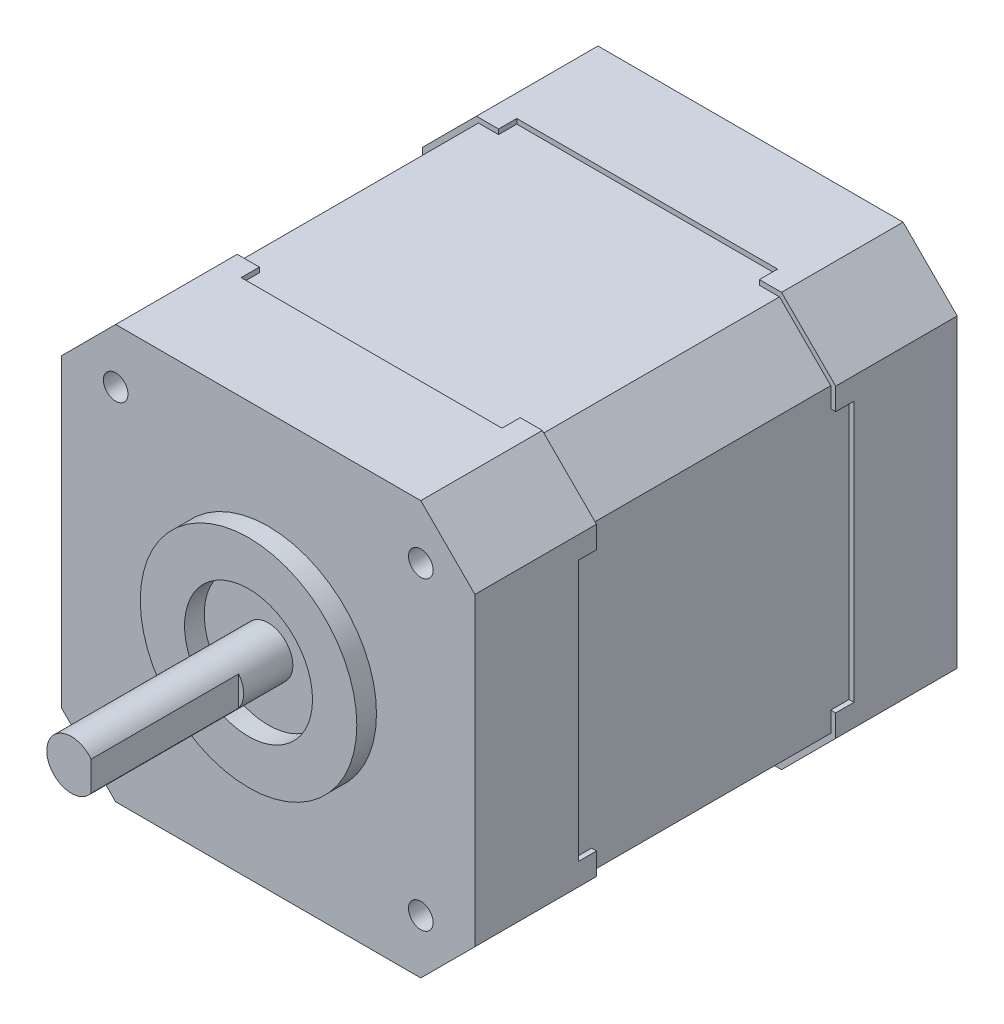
ISO-10303-21;
HEADER;
FILE_DESCRIPTION(('STEP AP214'),'2;1');
FILE_NAME('part.step','',(''),(''),'','','');
FILE_SCHEMA(('AUTOMOTIVE_DESIGN { 1 0 10303 214 1 1 1 1 }'));
ENDSEC;
DATA;
#1=APPLICATION_CONTEXT('core data for automotive mechanical design processes');
#2=APPLICATION_PROTOCOL_DEFINITION('international standard','automotive_design',2000,#1);
#3=PRODUCT_CONTEXT('',#1,'mechanical');
#4=PRODUCT('Part','Part','',(#3));
#5=PRODUCT_RELATED_PRODUCT_CATEGORY('part','',(#4));
#6=PRODUCT_DEFINITION_FORMATION('','',#4);
#7=PRODUCT_DEFINITION_CONTEXT('part definition',#1,'design');
#8=PRODUCT_DEFINITION('design','',#6,#7);
#9=PRODUCT_DEFINITION_SHAPE('','',#8);
#10=(LENGTH_UNIT() NAMED_UNIT(*) SI_UNIT(.MILLI.,.METRE.));
#11=(NAMED_UNIT(*) PLANE_ANGLE_UNIT() SI_UNIT($,.RADIAN.));
#12=(NAMED_UNIT(*) SI_UNIT($,.STERADIAN.) SOLID_ANGLE_UNIT());
#13=UNCERTAINTY_MEASURE_WITH_UNIT(LENGTH_MEASURE(1.E-05),#10,'distance_accuracy_value','');
#14=(GEOMETRIC_REPRESENTATION_CONTEXT(3) GLOBAL_UNCERTAINTY_ASSIGNED_CONTEXT((#13)) GLOBAL_UNIT_ASSIGNED_CONTEXT((#10,
#11,#12)) REPRESENTATION_CONTEXT('',''));
#15=CARTESIAN_POINT('',(0.,0.,0.));
#16=DIRECTION('',(0.,0.,1.));
#17=DIRECTION('',(1.,0.,0.));
#18=AXIS2_PLACEMENT_3D('',#15,#16,#17);
#19=CARTESIAN_POINT('',(21.,21.,-49.));
#20=DIRECTION('',(0.,0.,-1.));
#21=DIRECTION('',(-1.,0.,0.));
#22=AXIS2_PLACEMENT_3D('',#19,#20,#21);
#23=PLANE('',#22);
#24=DIRECTION('',(-1.,0.,0.));
#25=VECTOR('',#24,1.);
#26=CARTESIAN_POINT('',(-15.5,21.,-49.));
#27=LINE('',#26,#25);
#28=CARTESIAN_POINT('',(15.5,21.,-49.));
#29=VERTEX_POINT('',#28);
#30=CARTESIAN_POINT('',(-15.5,21.,-49.));
#31=VERTEX_POINT('',#30);
#32=EDGE_CURVE('E776',#29,#31,#27,.T.);
#33=ORIENTED_EDGE('',*,*,#32,.F.);
#34=DIRECTION('',(-0.707106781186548,0.707106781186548,0.));
#35=VECTOR('',#34,1.);
#36=CARTESIAN_POINT('',(15.5,21.,-49.));
#37=LINE('',#36,#35);
#38=CARTESIAN_POINT('',(21.,15.5,-49.));
#39=VERTEX_POINT('',#38);
#40=EDGE_CURVE('E798',#39,#29,#37,.T.);
#41=ORIENTED_EDGE('',*,*,#40,.F.);
#42=DIRECTION('',(0.,1.,0.));
#43=VECTOR('',#42,1.);
#44=CARTESIAN_POINT('',(21.,15.5,-49.));
#45=LINE('',#44,#43);
#46=CARTESIAN_POINT('',(21.,-15.5,-49.));
#47=VERTEX_POINT('',#46);
#48=EDGE_CURVE('E795',#47,#39,#45,.T.);
#49=ORIENTED_EDGE('',*,*,#48,.F.);
#50=DIRECTION('',(0.707106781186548,0.707106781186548,0.));
#51=VECTOR('',#50,1.);
#52=CARTESIAN_POINT('',(15.5,-21.,-49.));
#53=LINE('',#52,#51);
#54=CARTESIAN_POINT('',(15.5,-21.,-49.));
#55=VERTEX_POINT('',#54);
#56=EDGE_CURVE('E792',#55,#47,#53,.T.);
#57=ORIENTED_EDGE('',*,*,#56,.F.);
#58=DIRECTION('',(1.,0.,0.));
#59=VECTOR('',#58,1.);
#60=CARTESIAN_POINT('',(-15.5,-21.,-49.));
#61=LINE('',#60,#59);
#62=CARTESIAN_POINT('',(-15.5,-21.,-49.));
#63=VERTEX_POINT('',#62);
#64=EDGE_CURVE('E789',#63,#55,#61,.T.);
#65=ORIENTED_EDGE('',*,*,#64,.F.);
#66=DIRECTION('',(0.707106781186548,-0.707106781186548,0.));
#67=VECTOR('',#66,1.);
#68=CARTESIAN_POINT('',(-21.,-15.5,-49.));
#69=LINE('',#68,#67);
#70=CARTESIAN_POINT('',(-21.,-15.5,-49.));
#71=VERTEX_POINT('',#70);
#72=EDGE_CURVE('E786',#71,#63,#69,.T.);
#73=ORIENTED_EDGE('',*,*,#72,.F.);
#74=DIRECTION('',(0.,-1.,0.));
#75=VECTOR('',#74,1.);
#76=CARTESIAN_POINT('',(-21.,15.5,-49.));
#77=LINE('',#76,#75);
#78=CARTESIAN_POINT('',(-21.,15.5,-49.));
#79=VERTEX_POINT('',#78);
#80=EDGE_CURVE('E783',#79,#71,#77,.T.);
#81=ORIENTED_EDGE('',*,*,#80,.F.);
#82=DIRECTION('',(-0.707106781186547,-0.707106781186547,0.));
#83=VECTOR('',#82,1.);
#84=CARTESIAN_POINT('',(-21.,15.5,-49.));
#85=LINE('',#84,#83);
#86=EDGE_CURVE('E779',#31,#79,#85,.T.);
#87=ORIENTED_EDGE('',*,*,#86,.F.);
#88=EDGE_LOOP('',(#33,#41,#49,#57,#65,#73,#81,#87));
#89=FACE_BOUND('',#88,.T.);
#90=CARTESIAN_POINT('',(0.,0.,-49.));
#91=DIRECTION('',(0.,0.,-1.));
#92=DIRECTION('',(-1.,0.,0.));
#93=AXIS2_PLACEMENT_3D('',#90,#91,#92);
#94=CIRCLE('',#93,2.5);
#95=CARTESIAN_POINT('',(-2.5,0.,-49.));
#96=VERTEX_POINT('',#95);
#97=EDGE_CURVE('E435',#96,#96,#94,.T.);
#98=ORIENTED_EDGE('',*,*,#97,.F.);
#99=EDGE_LOOP('',(#98));
#100=FACE_BOUND('',#99,.T.);
#101=ADVANCED_FACE('F41',(#89,#100),#23,.T.);
#102=CARTESIAN_POINT('',(64.0067335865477,21.,-36.65));
#103=DIRECTION('',(0.,0.,1.));
#104=DIRECTION('',(1.,0.,0.));
#105=AXIS2_PLACEMENT_3D('',#102,#103,#104);
#106=PLANE('',#105);
#107=DIRECTION('',(-1.,0.,0.));
#108=VECTOR('',#107,1.);
#109=CARTESIAN_POINT('',(64.0067335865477,13.25,-36.65));
#110=LINE('',#109,#108);
#111=CARTESIAN_POINT('',(-20.5,13.25,-36.65));
#112=VERTEX_POINT('',#111);
#113=CARTESIAN_POINT('',(-21.,13.25,-36.65));
#114=VERTEX_POINT('',#113);
#115=EDGE_CURVE('E486',#112,#114,#110,.T.);
#116=ORIENTED_EDGE('',*,*,#115,.F.);
#117=DIRECTION('',(0.,1.,0.));
#118=VECTOR('',#117,1.);
#119=CARTESIAN_POINT('',(-20.5,-15.2928932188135,-36.65));
#120=LINE('',#119,#118);
#121=CARTESIAN_POINT('',(-20.5,15.2928932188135,-36.65));
#122=VERTEX_POINT('',#121);
#123=EDGE_CURVE('E621',#112,#122,#120,.T.);
#124=ORIENTED_EDGE('',*,*,#123,.T.);
#125=DIRECTION('',(0.707106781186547,0.707106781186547,0.));
#126=VECTOR('',#125,1.);
#127=CARTESIAN_POINT('',(-20.5,15.2928932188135,-36.65));
#128=LINE('',#127,#126);
#129=CARTESIAN_POINT('',(-15.2928932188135,20.5,-36.65));
#130=VERTEX_POINT('',#129);
#131=EDGE_CURVE('E616',#122,#130,#128,.T.);
#132=ORIENTED_EDGE('',*,*,#131,.T.);
#133=DIRECTION('',(-1.,0.,0.));
#134=VECTOR('',#133,1.);
#135=CARTESIAN_POINT('',(64.0067335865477,20.5,-36.65));
#136=LINE('',#135,#134);
#137=CARTESIAN_POINT('',(-13.25,20.5,-36.65));
#138=VERTEX_POINT('',#137);
#139=EDGE_CURVE('E742',#138,#130,#136,.T.);
#140=ORIENTED_EDGE('',*,*,#139,.F.);
#141=DIRECTION('',(0.,-1.,0.));
#142=VECTOR('',#141,1.);
#143=CARTESIAN_POINT('',(-13.25,21.,-36.65));
#144=LINE('',#143,#142);
#145=CARTESIAN_POINT('',(-13.25,21.,-36.65));
#146=VERTEX_POINT('',#145);
#147=EDGE_CURVE('E605',#146,#138,#144,.T.);
#148=ORIENTED_EDGE('',*,*,#147,.F.);
#149=DIRECTION('',(-1.,0.,0.));
#150=VECTOR('',#149,1.);
#151=CARTESIAN_POINT('',(64.0067335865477,21.,-36.65));
#152=LINE('',#151,#150);
#153=CARTESIAN_POINT('',(-15.5,21.,-36.65));
#154=VERTEX_POINT('',#153);
#155=EDGE_CURVE('E730',#146,#154,#152,.T.);
#156=ORIENTED_EDGE('',*,*,#155,.T.);
#157=DIRECTION('',(0.707106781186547,0.707106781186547,0.));
#158=VECTOR('',#157,1.);
#159=CARTESIAN_POINT('',(-21.,15.5,-36.65));
#160=LINE('',#159,#158);
#161=CARTESIAN_POINT('',(-21.,15.5,-36.65));
#162=VERTEX_POINT('',#161);
#163=EDGE_CURVE('E612',#162,#154,#160,.T.);
#164=ORIENTED_EDGE('',*,*,#163,.F.);
#165=DIRECTION('',(0.,1.,0.));
#166=VECTOR('',#165,1.);
#167=CARTESIAN_POINT('',(-21.,-15.5,-36.65));
#168=LINE('',#167,#166);
#169=EDGE_CURVE('E714',#114,#162,#168,.T.);
#170=ORIENTED_EDGE('',*,*,#169,.F.);
#171=EDGE_LOOP('',(#116,#124,#132,#140,#148,#156,#164,#170));
#172=FACE_BOUND('',#171,.T.);
#173=ADVANCED_FACE('F921',(#172),#106,.T.);
#174=CARTESIAN_POINT('',(64.0067335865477,21.,-12.35));
#175=DIRECTION('',(0.,0.,-1.));
#176=DIRECTION('',(-1.,0.,0.));
#177=AXIS2_PLACEMENT_3D('',#174,#175,#176);
#178=PLANE('',#177);
#179=DIRECTION('',(1.,0.,0.));
#180=VECTOR('',#179,1.);
#181=CARTESIAN_POINT('',(64.0067335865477,13.25,-12.35));
#182=LINE('',#181,#180);
#183=CARTESIAN_POINT('',(-21.,13.25,-12.35));
#184=VERTEX_POINT('',#183);
#185=CARTESIAN_POINT('',(-20.5,13.25,-12.35));
#186=VERTEX_POINT('',#185);
#187=EDGE_CURVE('E484',#184,#186,#182,.T.);
#188=ORIENTED_EDGE('',*,*,#187,.F.);
#189=DIRECTION('',(0.,1.,0.));
#190=VECTOR('',#189,1.);
#191=CARTESIAN_POINT('',(-21.,-15.5,-12.35));
#192=LINE('',#191,#190);
#193=CARTESIAN_POINT('',(-21.,15.5,-12.35));
#194=VERTEX_POINT('',#193);
#195=EDGE_CURVE('E710',#184,#194,#192,.T.);
#196=ORIENTED_EDGE('',*,*,#195,.T.);
#197=DIRECTION('',(0.707106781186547,0.707106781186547,0.));
#198=VECTOR('',#197,1.);
#199=CARTESIAN_POINT('',(-21.,15.5,-12.35));
#200=LINE('',#199,#198);
#201=CARTESIAN_POINT('',(-15.5,21.,-12.35));
#202=VERTEX_POINT('',#201);
#203=EDGE_CURVE('E722',#194,#202,#200,.T.);
#204=ORIENTED_EDGE('',*,*,#203,.T.);
#205=DIRECTION('',(-1.,0.,0.));
#206=VECTOR('',#205,1.);
#207=CARTESIAN_POINT('',(64.0067335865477,21.,-12.35));
#208=LINE('',#207,#206);
#209=CARTESIAN_POINT('',(-13.25,21.,-12.35));
#210=VERTEX_POINT('',#209);
#211=EDGE_CURVE('E607',#210,#202,#208,.T.);
#212=ORIENTED_EDGE('',*,*,#211,.F.);
#213=DIRECTION('',(0.,1.,0.));
#214=VECTOR('',#213,1.);
#215=CARTESIAN_POINT('',(-13.25,21.,-12.35));
#216=LINE('',#215,#214);
#217=CARTESIAN_POINT('',(-13.25,20.5,-12.35));
#218=VERTEX_POINT('',#217);
#219=EDGE_CURVE('E603',#218,#210,#216,.T.);
#220=ORIENTED_EDGE('',*,*,#219,.F.);
#221=DIRECTION('',(-1.,0.,0.));
#222=VECTOR('',#221,1.);
#223=CARTESIAN_POINT('',(64.0067335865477,20.5,-12.35));
#224=LINE('',#223,#222);
#225=CARTESIAN_POINT('',(-15.2928932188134,20.5,-12.35));
#226=VERTEX_POINT('',#225);
#227=EDGE_CURVE('E739',#218,#226,#224,.T.);
#228=ORIENTED_EDGE('',*,*,#227,.T.);
#229=DIRECTION('',(0.707106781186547,0.707106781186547,0.));
#230=VECTOR('',#229,1.);
#231=CARTESIAN_POINT('',(-20.5,15.2928932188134,-12.35));
#232=LINE('',#231,#230);
#233=CARTESIAN_POINT('',(-20.5,15.2928932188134,-12.35));
#234=VERTEX_POINT('',#233);
#235=EDGE_CURVE('E719',#234,#226,#232,.T.);
#236=ORIENTED_EDGE('',*,*,#235,.F.);
#237=DIRECTION('',(0.,1.,0.));
#238=VECTOR('',#237,1.);
#239=CARTESIAN_POINT('',(-20.5,-15.2928932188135,-12.35));
#240=LINE('',#239,#238);
#241=EDGE_CURVE('E706',#186,#234,#240,.T.);
#242=ORIENTED_EDGE('',*,*,#241,.F.);
#243=EDGE_LOOP('',(#188,#196,#204,#212,#220,#228,#236,#242));
#244=FACE_BOUND('',#243,.T.);
#245=ADVANCED_FACE('F927',(#244),#178,.T.);
#246=DIRECTION('',(1.,0.,0.));
#247=VECTOR('',#246,1.);
#248=CARTESIAN_POINT('',(64.0067335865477,-13.25,-36.65));
#249=LINE('',#248,#247);
#250=CARTESIAN_POINT('',(-21.,-13.25,-36.65));
#251=VERTEX_POINT('',#250);
#252=CARTESIAN_POINT('',(-20.5,-13.25,-36.65));
#253=VERTEX_POINT('',#252);
#254=EDGE_CURVE('E482',#251,#253,#249,.T.);
#255=ORIENTED_EDGE('',*,*,#254,.F.);
#256=CARTESIAN_POINT('',(-21.,-15.5,-36.65));
#257=VERTEX_POINT('',#256);
#258=EDGE_CURVE('E617',#257,#251,#168,.T.);
#259=ORIENTED_EDGE('',*,*,#258,.F.);
#260=DIRECTION('',(-0.707106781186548,0.707106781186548,0.));
#261=VECTOR('',#260,1.);
#262=CARTESIAN_POINT('',(-15.5,-21.,-36.65));
#263=LINE('',#262,#261);
#264=CARTESIAN_POINT('',(-15.5,-21.,-36.65));
#265=VERTEX_POINT('',#264);
#266=EDGE_CURVE('E698',#265,#257,#263,.T.);
#267=ORIENTED_EDGE('',*,*,#266,.F.);
#268=DIRECTION('',(-1.,0.,0.));
#269=VECTOR('',#268,1.);
#270=CARTESIAN_POINT('',(15.5,-21.,-36.65));
#271=LINE('',#270,#269);
#272=CARTESIAN_POINT('',(-13.25,-21.,-36.65));
#273=VERTEX_POINT('',#272);
#274=EDGE_CURVE('E687',#273,#265,#271,.T.);
#275=ORIENTED_EDGE('',*,*,#274,.F.);
#276=DIRECTION('',(0.,-1.,0.));
#277=VECTOR('',#276,1.);
#278=CARTESIAN_POINT('',(-13.25,21.,-36.65));
#279=LINE('',#278,#277);
#280=CARTESIAN_POINT('',(-13.25,-20.5,-36.65));
#281=VERTEX_POINT('',#280);
#282=EDGE_CURVE('E525',#281,#273,#279,.T.);
#283=ORIENTED_EDGE('',*,*,#282,.F.);
#284=DIRECTION('',(-1.,0.,0.));
#285=VECTOR('',#284,1.);
#286=CARTESIAN_POINT('',(15.2928932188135,-20.5,-36.65));
#287=LINE('',#286,#285);
#288=CARTESIAN_POINT('',(-15.2928932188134,-20.5,-36.65));
#289=VERTEX_POINT('',#288);
#290=EDGE_CURVE('E691',#281,#289,#287,.T.);
#291=ORIENTED_EDGE('',*,*,#290,.T.);
#292=DIRECTION('',(-0.707106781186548,0.707106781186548,0.));
#293=VECTOR('',#292,1.);
#294=CARTESIAN_POINT('',(-15.2928932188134,-20.5,-36.65));
#295=LINE('',#294,#293);
#296=CARTESIAN_POINT('',(-20.5,-15.2928932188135,-36.65));
#297=VERTEX_POINT('',#296);
#298=EDGE_CURVE('E622',#289,#297,#295,.T.);
#299=ORIENTED_EDGE('',*,*,#298,.T.);
#300=EDGE_CURVE('E703',#297,#253,#120,.T.);
#301=ORIENTED_EDGE('',*,*,#300,.T.);
#302=EDGE_LOOP('',(#255,#259,#267,#275,#283,#291,#299,#301));
#303=FACE_BOUND('',#302,.T.);
#304=ADVANCED_FACE('F930',(#303),#106,.T.);
#305=DIRECTION('',(-1.,0.,0.));
#306=VECTOR('',#305,1.);
#307=CARTESIAN_POINT('',(64.0067335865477,-13.25,-12.35));
#308=LINE('',#307,#306);
#309=CARTESIAN_POINT('',(-20.5,-13.25,-12.35));
#310=VERTEX_POINT('',#309);
#311=CARTESIAN_POINT('',(-21.,-13.25,-12.35));
#312=VERTEX_POINT('',#311);
#313=EDGE_CURVE('E56',#310,#312,#308,.T.);
#314=ORIENTED_EDGE('',*,*,#313,.F.);
#315=CARTESIAN_POINT('',(-20.5,-15.2928932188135,-12.35));
#316=VERTEX_POINT('',#315);
#317=EDGE_CURVE('E707',#316,#310,#240,.T.);
#318=ORIENTED_EDGE('',*,*,#317,.F.);
#319=DIRECTION('',(-0.707106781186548,0.707106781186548,0.));
#320=VECTOR('',#319,1.);
#321=CARTESIAN_POINT('',(-15.2928932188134,-20.5,-12.35));
#322=LINE('',#321,#320);
#323=CARTESIAN_POINT('',(-15.2928932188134,-20.5,-12.35));
#324=VERTEX_POINT('',#323);
#325=EDGE_CURVE('E626',#324,#316,#322,.T.);
#326=ORIENTED_EDGE('',*,*,#325,.F.);
#327=DIRECTION('',(-1.,0.,0.));
#328=VECTOR('',#327,1.);
#329=CARTESIAN_POINT('',(15.2928932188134,-20.5,-12.35));
#330=LINE('',#329,#328);
#331=CARTESIAN_POINT('',(-13.25,-20.5,-12.35));
#332=VERTEX_POINT('',#331);
#333=EDGE_CURVE('E679',#332,#324,#330,.T.);
#334=ORIENTED_EDGE('',*,*,#333,.F.);
#335=DIRECTION('',(0.,1.,0.));
#336=VECTOR('',#335,1.);
#337=CARTESIAN_POINT('',(-13.25,21.,-12.35));
#338=LINE('',#337,#336);
#339=CARTESIAN_POINT('',(-13.25,-21.,-12.35));
#340=VERTEX_POINT('',#339);
#341=EDGE_CURVE('E522',#340,#332,#338,.T.);
#342=ORIENTED_EDGE('',*,*,#341,.F.);
#343=DIRECTION('',(-1.,0.,0.));
#344=VECTOR('',#343,1.);
#345=CARTESIAN_POINT('',(15.5,-21.,-12.35));
#346=LINE('',#345,#344);
#347=CARTESIAN_POINT('',(-15.5,-21.,-12.35));
#348=VERTEX_POINT('',#347);
#349=EDGE_CURVE('E683',#340,#348,#346,.T.);
#350=ORIENTED_EDGE('',*,*,#349,.T.);
#351=DIRECTION('',(-0.707106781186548,0.707106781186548,0.));
#352=VECTOR('',#351,1.);
#353=CARTESIAN_POINT('',(-15.5,-21.,-12.35));
#354=LINE('',#353,#352);
#355=CARTESIAN_POINT('',(-21.,-15.5,-12.35));
#356=VERTEX_POINT('',#355);
#357=EDGE_CURVE('E696',#348,#356,#354,.T.);
#358=ORIENTED_EDGE('',*,*,#357,.T.);
#359=EDGE_CURVE('E711',#356,#312,#192,.T.);
#360=ORIENTED_EDGE('',*,*,#359,.T.);
#361=EDGE_LOOP('',(#314,#318,#326,#334,#342,#350,#358,#360));
#362=FACE_BOUND('',#361,.T.);
#363=ADVANCED_FACE('F995',(#362),#178,.T.);
#364=DIRECTION('',(-1.,0.,0.));
#365=VECTOR('',#364,1.);
#366=CARTESIAN_POINT('',(64.0067335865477,13.25,-36.65));
#367=LINE('',#366,#365);
#368=CARTESIAN_POINT('',(21.,13.25,-36.65));
#369=VERTEX_POINT('',#368);
#370=CARTESIAN_POINT('',(20.5,13.25,-36.65));
#371=VERTEX_POINT('',#370);
#372=EDGE_CURVE('E565',#369,#371,#367,.T.);
#373=ORIENTED_EDGE('',*,*,#372,.F.);
#374=DIRECTION('',(0.,-1.,0.));
#375=VECTOR('',#374,1.);
#376=CARTESIAN_POINT('',(21.,15.5,-36.65));
#377=LINE('',#376,#375);
#378=CARTESIAN_POINT('',(21.,15.5,-36.65));
#379=VERTEX_POINT('',#378);
#380=EDGE_CURVE('E651',#379,#369,#377,.T.);
#381=ORIENTED_EDGE('',*,*,#380,.F.);
#382=DIRECTION('',(0.707106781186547,-0.707106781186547,0.));
#383=VECTOR('',#382,1.);
#384=CARTESIAN_POINT('',(15.5,21.,-36.65));
#385=LINE('',#384,#383);
#386=CARTESIAN_POINT('',(15.5,21.,-36.65));
#387=VERTEX_POINT('',#386);
#388=EDGE_CURVE('E636',#387,#379,#385,.T.);
#389=ORIENTED_EDGE('',*,*,#388,.F.);
#390=CARTESIAN_POINT('',(13.25,21.,-36.65));
#391=VERTEX_POINT('',#390);
#392=EDGE_CURVE('E733',#387,#391,#152,.T.);
#393=ORIENTED_EDGE('',*,*,#392,.T.);
#394=DIRECTION('',(0.,1.,0.));
#395=VECTOR('',#394,1.);
#396=CARTESIAN_POINT('',(13.25,21.,-36.65));
#397=LINE('',#396,#395);
#398=CARTESIAN_POINT('',(13.25,20.5,-36.65));
#399=VERTEX_POINT('',#398);
#400=EDGE_CURVE('E601',#399,#391,#397,.T.);
#401=ORIENTED_EDGE('',*,*,#400,.F.);
#402=CARTESIAN_POINT('',(15.2928932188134,20.5,-36.65));
#403=VERTEX_POINT('',#402);
#404=EDGE_CURVE('E745',#403,#399,#136,.T.);
#405=ORIENTED_EDGE('',*,*,#404,.F.);
#406=DIRECTION('',(0.707106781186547,-0.707106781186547,0.));
#407=VECTOR('',#406,1.);
#408=CARTESIAN_POINT('',(15.2928932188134,20.5,-36.65));
#409=LINE('',#408,#407);
#410=CARTESIAN_POINT('',(20.5,15.2928932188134,-36.65));
#411=VERTEX_POINT('',#410);
#412=EDGE_CURVE('E640',#403,#411,#409,.T.);
#413=ORIENTED_EDGE('',*,*,#412,.T.);
#414=DIRECTION('',(0.,-1.,0.));
#415=VECTOR('',#414,1.);
#416=CARTESIAN_POINT('',(20.5,15.2928932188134,-36.65));
#417=LINE('',#416,#415);
#418=EDGE_CURVE('E655',#411,#371,#417,.T.);
#419=ORIENTED_EDGE('',*,*,#418,.T.);
#420=EDGE_LOOP('',(#373,#381,#389,#393,#401,#405,#413,#419));
#421=FACE_BOUND('',#420,.T.);
#422=ADVANCED_FACE('F886',(#421),#106,.T.);
#423=DIRECTION('',(1.,0.,0.));
#424=VECTOR('',#423,1.);
#425=CARTESIAN_POINT('',(64.0067335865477,13.25,-12.35));
#426=LINE('',#425,#424);
#427=CARTESIAN_POINT('',(20.5,13.25,-12.35));
#428=VERTEX_POINT('',#427);
#429=CARTESIAN_POINT('',(21.,13.25,-12.35));
#430=VERTEX_POINT('',#429);
#431=EDGE_CURVE('E563',#428,#430,#426,.T.);
#432=ORIENTED_EDGE('',*,*,#431,.F.);
#433=DIRECTION('',(0.,-1.,0.));
#434=VECTOR('',#433,1.);
#435=CARTESIAN_POINT('',(20.5,15.2928932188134,-12.35));
#436=LINE('',#435,#434);
#437=CARTESIAN_POINT('',(20.5,15.2928932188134,-12.35));
#438=VERTEX_POINT('',#437);
#439=EDGE_CURVE('E659',#438,#428,#436,.T.);
#440=ORIENTED_EDGE('',*,*,#439,.F.);
#441=DIRECTION('',(0.707106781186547,-0.707106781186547,0.));
#442=VECTOR('',#441,1.);
#443=CARTESIAN_POINT('',(15.2928932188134,20.5,-12.35));
#444=LINE('',#443,#442);
#445=CARTESIAN_POINT('',(15.2928932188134,20.5,-12.35));
#446=VERTEX_POINT('',#445);
#447=EDGE_CURVE('E643',#446,#438,#444,.T.);
#448=ORIENTED_EDGE('',*,*,#447,.F.);
#449=CARTESIAN_POINT('',(13.25,20.5,-12.35));
#450=VERTEX_POINT('',#449);
#451=EDGE_CURVE('E637',#446,#450,#224,.T.);
#452=ORIENTED_EDGE('',*,*,#451,.T.);
#453=DIRECTION('',(0.,-1.,0.));
#454=VECTOR('',#453,1.);
#455=CARTESIAN_POINT('',(13.25,21.,-12.35));
#456=LINE('',#455,#454);
#457=CARTESIAN_POINT('',(13.25,21.,-12.35));
#458=VERTEX_POINT('',#457);
#459=EDGE_CURVE('E598',#458,#450,#456,.T.);
#460=ORIENTED_EDGE('',*,*,#459,.F.);
#461=CARTESIAN_POINT('',(15.5,21.,-12.35));
#462=VERTEX_POINT('',#461);
#463=EDGE_CURVE('E727',#462,#458,#208,.T.);
#464=ORIENTED_EDGE('',*,*,#463,.F.);
#465=DIRECTION('',(0.707106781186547,-0.707106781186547,0.));
#466=VECTOR('',#465,1.);
#467=CARTESIAN_POINT('',(15.5,21.,-12.35));
#468=LINE('',#467,#466);
#469=CARTESIAN_POINT('',(21.,15.5,-12.35));
#470=VERTEX_POINT('',#469);
#471=EDGE_CURVE('E632',#462,#470,#468,.T.);
#472=ORIENTED_EDGE('',*,*,#471,.T.);
#473=DIRECTION('',(0.,-1.,0.));
#474=VECTOR('',#473,1.);
#475=CARTESIAN_POINT('',(21.,15.5,-12.35));
#476=LINE('',#475,#474);
#477=EDGE_CURVE('E647',#470,#430,#476,.T.);
#478=ORIENTED_EDGE('',*,*,#477,.T.);
#479=EDGE_LOOP('',(#432,#440,#448,#452,#460,#464,#472,#478));
#480=FACE_BOUND('',#479,.T.);
#481=ADVANCED_FACE('F987',(#480),#178,.T.);
#482=CARTESIAN_POINT('',(-15.5,21.,-49.));
#483=DIRECTION('',(0.,1.,0.));
#484=DIRECTION('',(0.,0.,1.));
#485=AXIS2_PLACEMENT_3D('',#482,#483,#484);
#486=PLANE('',#485);
#487=DIRECTION('',(0.,0.,1.));
#488=VECTOR('',#487,1.);
#489=CARTESIAN_POINT('',(-13.25,21.,-38.5));
#490=LINE('',#489,#488);
#491=CARTESIAN_POINT('',(-13.25,21.,-10.5));
#492=VERTEX_POINT('',#491);
#493=EDGE_CURVE('E567',#210,#492,#490,.T.);
#494=ORIENTED_EDGE('',*,*,#493,.F.);
#495=ORIENTED_EDGE('',*,*,#211,.T.);
#496=DIRECTION('',(0.,0.,1.));
#497=VECTOR('',#496,1.);
#498=CARTESIAN_POINT('',(-15.5,21.,-49.));
#499=LINE('',#498,#497);
#500=CARTESIAN_POINT('',(-15.5,21.,0.));
#501=VERTEX_POINT('',#500);
#502=EDGE_CURVE('E801',#202,#501,#499,.T.);
#503=ORIENTED_EDGE('',*,*,#502,.T.);
#504=DIRECTION('',(-1.,0.,0.));
#505=VECTOR('',#504,1.);
#506=CARTESIAN_POINT('',(-15.5,21.,0.));
#507=LINE('',#506,#505);
#508=CARTESIAN_POINT('',(15.5,21.,0.));
#509=VERTEX_POINT('',#508);
#510=EDGE_CURVE('E775',#509,#501,#507,.T.);
#511=ORIENTED_EDGE('',*,*,#510,.F.);
#512=DIRECTION('',(0.,0.,1.));
#513=VECTOR('',#512,1.);
#514=CARTESIAN_POINT('',(15.5,21.,-49.));
#515=LINE('',#514,#513);
#516=EDGE_CURVE('E828',#462,#509,#515,.T.);
#517=ORIENTED_EDGE('',*,*,#516,.F.);
#518=ORIENTED_EDGE('',*,*,#463,.T.);
#519=DIRECTION('',(0.,0.,-1.));
#520=VECTOR('',#519,1.);
#521=CARTESIAN_POINT('',(13.25,21.,-38.5));
#522=LINE('',#521,#520);
#523=CARTESIAN_POINT('',(13.25,21.,-10.5));
#524=VERTEX_POINT('',#523);
#525=EDGE_CURVE('E582',#524,#458,#522,.T.);
#526=ORIENTED_EDGE('',*,*,#525,.F.);
#527=DIRECTION('',(1.,0.,0.));
#528=VECTOR('',#527,1.);
#529=CARTESIAN_POINT('',(-13.25,21.,-10.5));
#530=LINE('',#529,#528);
#531=EDGE_CURVE('E579',#492,#524,#530,.T.);
#532=ORIENTED_EDGE('',*,*,#531,.F.);
#533=EDGE_LOOP('',(#494,#495,#503,#511,#517,#518,#526,#532));
#534=FACE_BOUND('',#533,.T.);
#535=ADVANCED_FACE('F979',(#534),#486,.T.);
#536=CARTESIAN_POINT('',(15.5,21.,-49.));
#537=DIRECTION('',(0.707106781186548,0.707106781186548,0.));
#538=DIRECTION('',(-0.707106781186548,0.707106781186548,0.));
#539=AXIS2_PLACEMENT_3D('',#536,#537,#538);
#540=PLANE('',#539);
#541=DIRECTION('',(0.,0.,1.));
#542=VECTOR('',#541,1.);
#543=CARTESIAN_POINT('',(21.,15.5,-49.));
#544=LINE('',#543,#542);
#545=CARTESIAN_POINT('',(21.,15.5,0.));
#546=VERTEX_POINT('',#545);
#547=EDGE_CURVE('E832',#470,#546,#544,.T.);
#548=ORIENTED_EDGE('',*,*,#547,.F.);
#549=ORIENTED_EDGE('',*,*,#471,.F.);
#550=ORIENTED_EDGE('',*,*,#516,.T.);
#551=DIRECTION('',(-0.707106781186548,0.707106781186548,0.));
#552=VECTOR('',#551,1.);
#553=CARTESIAN_POINT('',(15.5,21.,0.));
#554=LINE('',#553,#552);
#555=EDGE_CURVE('E780',#546,#509,#554,.T.);
#556=ORIENTED_EDGE('',*,*,#555,.F.);
#557=EDGE_LOOP('',(#548,#549,#550,#556));
#558=FACE_BOUND('',#557,.T.);
#559=ADVANCED_FACE('F949',(#558),#540,.T.);
#560=CARTESIAN_POINT('',(21.,15.5,-49.));
#561=DIRECTION('',(1.,0.,0.));
#562=DIRECTION('',(0.,1.,0.));
#563=AXIS2_PLACEMENT_3D('',#560,#561,#562);
#564=PLANE('',#563);
#565=DIRECTION('',(0.,0.,1.));
#566=VECTOR('',#565,1.);
#567=CARTESIAN_POINT('',(21.,13.25,-10.5));
#568=LINE('',#567,#566);
#569=CARTESIAN_POINT('',(21.,13.25,-10.5));
#570=VERTEX_POINT('',#569);
#571=EDGE_CURVE('E544',#430,#570,#568,.T.);
#572=ORIENTED_EDGE('',*,*,#571,.F.);
#573=ORIENTED_EDGE('',*,*,#477,.F.);
#574=ORIENTED_EDGE('',*,*,#547,.T.);
#575=DIRECTION('',(0.,1.,0.));
#576=VECTOR('',#575,1.);
#577=CARTESIAN_POINT('',(21.,15.5,0.));
#578=LINE('',#577,#576);
#579=CARTESIAN_POINT('',(21.,-15.5,0.));
#580=VERTEX_POINT('',#579);
#581=EDGE_CURVE('E819',#580,#546,#578,.T.);
#582=ORIENTED_EDGE('',*,*,#581,.F.);
#583=DIRECTION('',(0.,0.,1.));
#584=VECTOR('',#583,1.);
#585=CARTESIAN_POINT('',(21.,-15.5,-49.));
#586=LINE('',#585,#584);
#587=CARTESIAN_POINT('',(21.,-15.5,-12.35));
#588=VERTEX_POINT('',#587);
#589=EDGE_CURVE('E836',#588,#580,#586,.T.);
#590=ORIENTED_EDGE('',*,*,#589,.F.);
#591=CARTESIAN_POINT('',(21.,-13.25,-12.35));
#592=VERTEX_POINT('',#591);
#593=EDGE_CURVE('E631',#592,#588,#476,.T.);
#594=ORIENTED_EDGE('',*,*,#593,.F.);
#595=DIRECTION('',(0.,0.,-1.));
#596=VECTOR('',#595,1.);
#597=CARTESIAN_POINT('',(21.,-13.25,-10.5));
#598=LINE('',#597,#596);
#599=CARTESIAN_POINT('',(21.,-13.25,-10.5));
#600=VERTEX_POINT('',#599);
#601=EDGE_CURVE('E539',#600,#592,#598,.T.);
#602=ORIENTED_EDGE('',*,*,#601,.F.);
#603=DIRECTION('',(0.,-1.,0.));
#604=VECTOR('',#603,1.);
#605=CARTESIAN_POINT('',(21.,13.25,-10.5));
#606=LINE('',#605,#604);
#607=EDGE_CURVE('E527',#570,#600,#606,.T.);
#608=ORIENTED_EDGE('',*,*,#607,.F.);
#609=EDGE_LOOP('',(#572,#573,#574,#582,#590,#594,#602,#608));
#610=FACE_BOUND('',#609,.T.);
#611=ADVANCED_FACE('F954',(#610),#564,.T.);
#612=CARTESIAN_POINT('',(15.5,-21.,-49.));
#613=DIRECTION('',(0.707106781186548,-0.707106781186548,0.));
#614=DIRECTION('',(0.707106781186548,0.707106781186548,0.));
#615=AXIS2_PLACEMENT_3D('',#612,#613,#614);
#616=PLANE('',#615);
#617=DIRECTION('',(0.,0.,1.));
#618=VECTOR('',#617,1.);
#619=CARTESIAN_POINT('',(15.5,-21.,-49.));
#620=LINE('',#619,#618);
#621=CARTESIAN_POINT('',(15.5,-21.,-12.35));
#622=VERTEX_POINT('',#621);
#623=CARTESIAN_POINT('',(15.5,-21.,0.));
#624=VERTEX_POINT('',#623);
#625=EDGE_CURVE('E840',#622,#624,#620,.T.);
#626=ORIENTED_EDGE('',*,*,#625,.F.);
#627=DIRECTION('',(-0.707106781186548,-0.707106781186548,0.));
#628=VECTOR('',#627,1.);
#629=CARTESIAN_POINT('',(21.,-15.5,-12.35));
#630=LINE('',#629,#628);
#631=EDGE_CURVE('E665',#588,#622,#630,.T.);
#632=ORIENTED_EDGE('',*,*,#631,.F.);
#633=ORIENTED_EDGE('',*,*,#589,.T.);
#634=DIRECTION('',(0.707106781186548,0.707106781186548,0.));
#635=VECTOR('',#634,1.);
#636=CARTESIAN_POINT('',(15.5,-21.,0.));
#637=LINE('',#636,#635);
#638=EDGE_CURVE('E816',#624,#580,#637,.T.);
#639=ORIENTED_EDGE('',*,*,#638,.F.);
#640=EDGE_LOOP('',(#626,#632,#633,#639));
#641=FACE_BOUND('',#640,.T.);
#642=ADVANCED_FACE('F959',(#641),#616,.T.);
#643=CARTESIAN_POINT('',(-15.5,-21.,-49.));
#644=DIRECTION('',(0.,-1.,0.));
#645=DIRECTION('',(1.,0.,0.));
#646=AXIS2_PLACEMENT_3D('',#643,#644,#645);
#647=PLANE('',#646);
#648=DIRECTION('',(0.,0.,-1.));
#649=VECTOR('',#648,1.);
#650=CARTESIAN_POINT('',(-13.25,-21.,-10.5));
#651=LINE('',#650,#649);
#652=CARTESIAN_POINT('',(-13.25,-21.,-10.5));
#653=VERTEX_POINT('',#652);
#654=EDGE_CURVE('E488',#653,#340,#651,.T.);
#655=ORIENTED_EDGE('',*,*,#654,.F.);
#656=DIRECTION('',(-1.,0.,0.));
#657=VECTOR('',#656,1.);
#658=CARTESIAN_POINT('',(-13.25,-21.,-10.5));
#659=LINE('',#658,#657);
#660=CARTESIAN_POINT('',(13.25,-21.,-10.5));
#661=VERTEX_POINT('',#660);
#662=EDGE_CURVE('E505',#661,#653,#659,.T.);
#663=ORIENTED_EDGE('',*,*,#662,.F.);
#664=DIRECTION('',(0.,0.,1.));
#665=VECTOR('',#664,1.);
#666=CARTESIAN_POINT('',(13.25,-21.,-10.5));
#667=LINE('',#666,#665);
#668=CARTESIAN_POINT('',(13.25,-21.,-12.35));
#669=VERTEX_POINT('',#668);
#670=EDGE_CURVE('E502',#669,#661,#667,.T.);
#671=ORIENTED_EDGE('',*,*,#670,.F.);
#672=EDGE_CURVE('E684',#622,#669,#346,.T.);
#673=ORIENTED_EDGE('',*,*,#672,.F.);
#674=ORIENTED_EDGE('',*,*,#625,.T.);
#675=DIRECTION('',(1.,0.,0.));
#676=VECTOR('',#675,1.);
#677=CARTESIAN_POINT('',(-15.5,-21.,0.));
#678=LINE('',#677,#676);
#679=CARTESIAN_POINT('',(-15.5,-21.,0.));
#680=VERTEX_POINT('',#679);
#681=EDGE_CURVE('E813',#680,#624,#678,.T.);
#682=ORIENTED_EDGE('',*,*,#681,.F.);
#683=DIRECTION('',(0.,0.,1.));
#684=VECTOR('',#683,1.);
#685=CARTESIAN_POINT('',(-15.5,-21.,-49.));
#686=LINE('',#685,#684);
#687=EDGE_CURVE('E844',#348,#680,#686,.T.);
#688=ORIENTED_EDGE('',*,*,#687,.F.);
#689=ORIENTED_EDGE('',*,*,#349,.F.);
#690=EDGE_LOOP('',(#655,#663,#671,#673,#674,#682,#688,#689));
#691=FACE_BOUND('',#690,.T.);
#692=ADVANCED_FACE('F964',(#691),#647,.T.);
#693=CARTESIAN_POINT('',(-21.,-15.5,-49.));
#694=DIRECTION('',(-0.707106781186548,-0.707106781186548,0.));
#695=DIRECTION('',(0.707106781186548,-0.707106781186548,0.));
#696=AXIS2_PLACEMENT_3D('',#693,#694,#695);
#697=PLANE('',#696);
#698=DIRECTION('',(0.,0.,1.));
#699=VECTOR('',#698,1.);
#700=CARTESIAN_POINT('',(-21.,-15.5,-49.));
#701=LINE('',#700,#699);
#702=CARTESIAN_POINT('',(-21.,-15.5,0.));
#703=VERTEX_POINT('',#702);
#704=EDGE_CURVE('E848',#356,#703,#701,.T.);
#705=ORIENTED_EDGE('',*,*,#704,.F.);
#706=ORIENTED_EDGE('',*,*,#357,.F.);
#707=ORIENTED_EDGE('',*,*,#687,.T.);
#708=DIRECTION('',(0.707106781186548,-0.707106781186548,0.));
#709=VECTOR('',#708,1.);
#710=CARTESIAN_POINT('',(-21.,-15.5,0.));
#711=LINE('',#710,#709);
#712=EDGE_CURVE('E810',#703,#680,#711,.T.);
#713=ORIENTED_EDGE('',*,*,#712,.F.);
#714=EDGE_LOOP('',(#705,#706,#707,#713));
#715=FACE_BOUND('',#714,.T.);
#716=ADVANCED_FACE('F969',(#715),#697,.T.);
#717=CARTESIAN_POINT('',(-21.,15.5,-49.));
#718=DIRECTION('',(-1.,0.,0.));
#719=DIRECTION('',(0.,-1.,0.));
#720=AXIS2_PLACEMENT_3D('',#717,#718,#719);
#721=PLANE('',#720);
#722=DIRECTION('',(0.,0.,-1.));
#723=VECTOR('',#722,1.);
#724=CARTESIAN_POINT('',(-21.,13.25,-38.5));
#725=LINE('',#724,#723);
#726=CARTESIAN_POINT('',(-21.,13.25,-10.5));
#727=VERTEX_POINT('',#726);
#728=EDGE_CURVE('E469',#727,#184,#725,.T.);
#729=ORIENTED_EDGE('',*,*,#728,.F.);
#730=DIRECTION('',(0.,1.,0.));
#731=VECTOR('',#730,1.);
#732=CARTESIAN_POINT('',(-21.,13.25,-10.5));
#733=LINE('',#732,#731);
#734=CARTESIAN_POINT('',(-21.,-13.25,-10.5));
#735=VERTEX_POINT('',#734);
#736=EDGE_CURVE('E466',#735,#727,#733,.T.);
#737=ORIENTED_EDGE('',*,*,#736,.F.);
#738=DIRECTION('',(0.,0.,1.));
#739=VECTOR('',#738,1.);
#740=CARTESIAN_POINT('',(-21.,-13.25,-38.5));
#741=LINE('',#740,#739);
#742=EDGE_CURVE('E463',#312,#735,#741,.T.);
#743=ORIENTED_EDGE('',*,*,#742,.F.);
#744=ORIENTED_EDGE('',*,*,#359,.F.);
#745=ORIENTED_EDGE('',*,*,#704,.T.);
#746=DIRECTION('',(0.,-1.,0.));
#747=VECTOR('',#746,1.);
#748=CARTESIAN_POINT('',(-21.,15.5,0.));
#749=LINE('',#748,#747);
#750=CARTESIAN_POINT('',(-21.,15.5,0.));
#751=VERTEX_POINT('',#750);
#752=EDGE_CURVE('E807',#751,#703,#749,.T.);
#753=ORIENTED_EDGE('',*,*,#752,.F.);
#754=DIRECTION('',(0.,0.,1.));
#755=VECTOR('',#754,1.);
#756=CARTESIAN_POINT('',(-21.,15.5,-49.));
#757=LINE('',#756,#755);
#758=EDGE_CURVE('E852',#194,#751,#757,.T.);
#759=ORIENTED_EDGE('',*,*,#758,.F.);
#760=ORIENTED_EDGE('',*,*,#195,.F.);
#761=EDGE_LOOP('',(#729,#737,#743,#744,#745,#753,#759,#760));
#762=FACE_BOUND('',#761,.T.);
#763=ADVANCED_FACE('F974',(#762),#721,.T.);
#764=CARTESIAN_POINT('',(-21.,15.5,-49.));
#765=DIRECTION('',(-0.707106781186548,0.707106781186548,0.));
#766=DIRECTION('',(-0.707106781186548,-0.707106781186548,0.));
#767=AXIS2_PLACEMENT_3D('',#764,#765,#766);
#768=PLANE('',#767);
#769=ORIENTED_EDGE('',*,*,#502,.F.);
#770=ORIENTED_EDGE('',*,*,#203,.F.);
#771=ORIENTED_EDGE('',*,*,#758,.T.);
#772=DIRECTION('',(-0.707106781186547,-0.707106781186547,0.));
#773=VECTOR('',#772,1.);
#774=CARTESIAN_POINT('',(-21.,15.5,0.));
#775=LINE('',#774,#773);
#776=EDGE_CURVE('E804',#501,#751,#775,.T.);
#777=ORIENTED_EDGE('',*,*,#776,.F.);
#778=EDGE_LOOP('',(#769,#770,#771,#777));
#779=FACE_BOUND('',#778,.T.);
#780=ADVANCED_FACE('F942',(#779),#768,.T.);
#781=CARTESIAN_POINT('',(21.,21.,0.));
#782=DIRECTION('',(0.,0.,-1.));
#783=DIRECTION('',(-1.,0.,0.));
#784=AXIS2_PLACEMENT_3D('',#781,#782,#783);
#785=PLANE('',#784);
#786=CARTESIAN_POINT('',(0.,0.,0.));
#787=DIRECTION('',(0.,0.,1.));
#788=DIRECTION('',(1.,0.,0.));
#789=AXIS2_PLACEMENT_3D('',#786,#787,#788);
#790=CIRCLE('',#789,6.5);
#791=CARTESIAN_POINT('',(6.5,0.,0.));
#792=VERTEX_POINT('',#791);
#793=EDGE_CURVE('E766',#792,#792,#790,.T.);
#794=ORIENTED_EDGE('',*,*,#793,.T.);
#795=EDGE_LOOP('',(#794));
#796=FACE_BOUND('',#795,.T.);
#797=CARTESIAN_POINT('',(0.,0.,0.));
#798=DIRECTION('',(0.,0.,-1.));
#799=DIRECTION('',(-1.,0.,0.));
#800=AXIS2_PLACEMENT_3D('',#797,#798,#799);
#801=CIRCLE('',#800,2.5);
#802=CARTESIAN_POINT('',(-2.5,0.,0.));
#803=VERTEX_POINT('',#802);
#804=EDGE_CURVE('E858',#803,#803,#801,.F.);
#805=ORIENTED_EDGE('',*,*,#804,.F.);
#806=EDGE_LOOP('',(#805));
#807=FACE_BOUND('',#806,.T.);
#808=ADVANCED_FACE('F938',(#796,#807),#785,.F.);
#809=CARTESIAN_POINT('',(-15.5,15.5,0.));
#810=DIRECTION('',(0.,0.,1.));
#811=DIRECTION('',(1.,0.,0.));
#812=AXIS2_PLACEMENT_3D('',#809,#810,#811);
#813=CIRCLE('',#812,1.25);
#814=CARTESIAN_POINT('',(-14.25,15.5,0.));
#815=VERTEX_POINT('',#814);
#816=EDGE_CURVE('E429',#815,#815,#813,.T.);
#817=ORIENTED_EDGE('',*,*,#816,.F.);
#818=EDGE_LOOP('',(#817));
#819=FACE_BOUND('',#818,.T.);
#820=CARTESIAN_POINT('',(15.5,15.5,0.));
#821=DIRECTION('',(0.,0.,1.));
#822=DIRECTION('',(1.,0.,0.));
#823=AXIS2_PLACEMENT_3D('',#820,#821,#822);
#824=CIRCLE('',#823,1.25);
#825=CARTESIAN_POINT('',(16.75,15.5,0.));
#826=VERTEX_POINT('',#825);
#827=EDGE_CURVE('E428',#826,#826,#824,.T.);
#828=ORIENTED_EDGE('',*,*,#827,.F.);
#829=EDGE_LOOP('',(#828));
#830=FACE_BOUND('',#829,.T.);
#831=CARTESIAN_POINT('',(15.5,-15.5,0.));
#832=DIRECTION('',(0.,0.,1.));
#833=DIRECTION('',(1.,0.,0.));
#834=AXIS2_PLACEMENT_3D('',#831,#832,#833);
#835=CIRCLE('',#834,1.25);
#836=CARTESIAN_POINT('',(16.75,-15.5,0.));
#837=VERTEX_POINT('',#836);
#838=EDGE_CURVE('E441',#837,#837,#835,.T.);
#839=ORIENTED_EDGE('',*,*,#838,.F.);
#840=EDGE_LOOP('',(#839));
#841=FACE_BOUND('',#840,.T.);
#842=CARTESIAN_POINT('',(-15.5,-15.5,0.));
#843=DIRECTION('',(0.,0.,1.));
#844=DIRECTION('',(1.,0.,0.));
#845=AXIS2_PLACEMENT_3D('',#842,#843,#844);
#846=CIRCLE('',#845,1.25);
#847=CARTESIAN_POINT('',(-14.25,-15.5,0.));
#848=VERTEX_POINT('',#847);
#849=EDGE_CURVE('E447',#848,#848,#846,.T.);
#850=ORIENTED_EDGE('',*,*,#849,.F.);
#851=EDGE_LOOP('',(#850));
#852=FACE_BOUND('',#851,.T.);
#853=ORIENTED_EDGE('',*,*,#510,.T.);
#854=ORIENTED_EDGE('',*,*,#776,.T.);
#855=ORIENTED_EDGE('',*,*,#752,.T.);
#856=ORIENTED_EDGE('',*,*,#712,.T.);
#857=ORIENTED_EDGE('',*,*,#681,.T.);
#858=ORIENTED_EDGE('',*,*,#638,.T.);
#859=ORIENTED_EDGE('',*,*,#581,.T.);
#860=ORIENTED_EDGE('',*,*,#555,.T.);
#861=EDGE_LOOP('',(#853,#854,#855,#856,#857,#858,#859,#860));
#862=FACE_BOUND('',#861,.T.);
#863=CARTESIAN_POINT('',(0.,0.,0.));
#864=DIRECTION('',(0.,0.,-1.));
#865=DIRECTION('',(-1.,0.,0.));
#866=AXIS2_PLACEMENT_3D('',#863,#864,#865);
#867=CIRCLE('',#866,11.);
#868=CARTESIAN_POINT('',(-11.,0.,0.));
#869=VERTEX_POINT('',#868);
#870=EDGE_CURVE('E827',#869,#869,#867,.F.);
#871=ORIENTED_EDGE('',*,*,#870,.F.);
#872=EDGE_LOOP('',(#871));
#873=FACE_BOUND('',#872,.T.);
#874=ADVANCED_FACE('F941',(#819,#830,#841,#852,#862,#873),#785,.F.);
#875=CARTESIAN_POINT('',(0.,0.,2.));
#876=DIRECTION('',(0.,0.,1.));
#877=DIRECTION('',(1.,0.,0.));
#878=AXIS2_PLACEMENT_3D('',#875,#876,#877);
#879=PLANE('',#878);
#880=CARTESIAN_POINT('',(0.,0.,2.));
#881=DIRECTION('',(0.,0.,1.));
#882=DIRECTION('',(1.,0.,0.));
#883=AXIS2_PLACEMENT_3D('',#880,#881,#882);
#884=CIRCLE('',#883,11.);
#885=CARTESIAN_POINT('',(11.,0.,2.));
#886=VERTEX_POINT('',#885);
#887=EDGE_CURVE('E770',#886,#886,#884,.T.);
#888=ORIENTED_EDGE('',*,*,#887,.T.);
#889=EDGE_LOOP('',(#888));
#890=FACE_BOUND('',#889,.T.);
#891=CARTESIAN_POINT('',(0.,0.,2.));
#892=DIRECTION('',(0.,0.,1.));
#893=DIRECTION('',(1.,0.,0.));
#894=AXIS2_PLACEMENT_3D('',#891,#892,#893);
#895=CIRCLE('',#894,6.5);
#896=CARTESIAN_POINT('',(6.5,0.,2.));
#897=VERTEX_POINT('',#896);
#898=EDGE_CURVE('E767',#897,#897,#895,.T.);
#899=ORIENTED_EDGE('',*,*,#898,.F.);
#900=EDGE_LOOP('',(#899));
#901=FACE_BOUND('',#900,.T.);
#902=ADVANCED_FACE('F1178',(#890,#901),#879,.T.);
#903=CARTESIAN_POINT('',(0.,0.,2.));
#904=DIRECTION('',(0.,0.,-1.));
#905=DIRECTION('',(-1.,0.,0.));
#906=AXIS2_PLACEMENT_3D('',#903,#904,#905);
#907=CYLINDRICAL_SURFACE('',#906,11.);
#908=ORIENTED_EDGE('',*,*,#887,.F.);
#909=EDGE_LOOP('',(#908));
#910=FACE_BOUND('',#909,.T.);
#911=ORIENTED_EDGE('',*,*,#870,.T.);
#912=EDGE_LOOP('',(#911));
#913=FACE_BOUND('',#912,.T.);
#914=ADVANCED_FACE('F936',(#910,#913),#907,.T.);
#915=CARTESIAN_POINT('',(0.,0.,2.));
#916=DIRECTION('',(0.,0.,-1.));
#917=DIRECTION('',(-1.,0.,0.));
#918=AXIS2_PLACEMENT_3D('',#915,#916,#917);
#919=CYLINDRICAL_SURFACE('',#918,6.5);
#920=ORIENTED_EDGE('',*,*,#898,.T.);
#921=EDGE_LOOP('',(#920));
#922=FACE_BOUND('',#921,.T.);
#923=ORIENTED_EDGE('',*,*,#793,.F.);
#924=EDGE_LOOP('',(#923));
#925=FACE_BOUND('',#924,.T.);
#926=ADVANCED_FACE('F1174',(#922,#925),#919,.F.);
#927=CARTESIAN_POINT('',(0.,0.,20.));
#928=DIRECTION('',(0.,0.,-1.));
#929=DIRECTION('',(-1.,0.,0.));
#930=AXIS2_PLACEMENT_3D('',#927,#928,#929);
#931=CYLINDRICAL_SURFACE('',#930,2.5);
#932=CARTESIAN_POINT('',(0.,0.,20.));
#933=DIRECTION('',(0.,0.,1.));
#934=DIRECTION('',(1.,0.,0.));
#935=AXIS2_PLACEMENT_3D('',#932,#933,#934);
#936=CIRCLE('',#935,2.5);
#937=CARTESIAN_POINT('',(2.,1.5,20.));
#938=VERTEX_POINT('',#937);
#939=CARTESIAN_POINT('',(2.,-1.5,20.));
#940=VERTEX_POINT('',#939);
#941=EDGE_CURVE('E762',#938,#940,#936,.T.);
#942=ORIENTED_EDGE('',*,*,#941,.F.);
#943=DIRECTION('',(0.,0.,1.));
#944=VECTOR('',#943,1.);
#945=CARTESIAN_POINT('',(2.,1.5,5.));
#946=LINE('',#945,#944);
#947=CARTESIAN_POINT('',(2.,1.5,5.));
#948=VERTEX_POINT('',#947);
#949=EDGE_CURVE('E757',#948,#938,#946,.T.);
#950=ORIENTED_EDGE('',*,*,#949,.F.);
#951=CARTESIAN_POINT('',(0.,0.,5.));
#952=DIRECTION('',(0.,0.,1.));
#953=DIRECTION('',(1.,0.,0.));
#954=AXIS2_PLACEMENT_3D('',#951,#952,#953);
#955=CIRCLE('',#954,2.5);
#956=CARTESIAN_POINT('',(2.,-1.5,5.));
#957=VERTEX_POINT('',#956);
#958=EDGE_CURVE('E751',#957,#948,#955,.T.);
#959=ORIENTED_EDGE('',*,*,#958,.F.);
#960=DIRECTION('',(0.,0.,1.));
#961=VECTOR('',#960,1.);
#962=CARTESIAN_POINT('',(2.,-1.5,5.));
#963=LINE('',#962,#961);
#964=EDGE_CURVE('E759',#957,#940,#963,.T.);
#965=ORIENTED_EDGE('',*,*,#964,.T.);
#966=EDGE_LOOP('',(#942,#950,#959,#965));
#967=FACE_BOUND('',#966,.T.);
#968=ORIENTED_EDGE('',*,*,#804,.T.);
#969=EDGE_LOOP('',(#968));
#970=FACE_BOUND('',#969,.T.);
#971=ADVANCED_FACE('F1170',(#967,#970),#931,.T.);
#972=CARTESIAN_POINT('',(0.,0.,20.));
#973=DIRECTION('',(0.,0.,1.));
#974=DIRECTION('',(1.,0.,0.));
#975=AXIS2_PLACEMENT_3D('',#972,#973,#974);
#976=PLANE('',#975);
#977=DIRECTION('',(0.,-1.,0.));
#978=VECTOR('',#977,1.);
#979=CARTESIAN_POINT('',(2.,1.5,20.));
#980=LINE('',#979,#978);
#981=EDGE_CURVE('E611',#938,#940,#980,.T.);
#982=ORIENTED_EDGE('',*,*,#981,.F.);
#983=ORIENTED_EDGE('',*,*,#941,.T.);
#984=EDGE_LOOP('',(#982,#983));
#985=FACE_BOUND('',#984,.T.);
#986=ADVANCED_FACE('F1166',(#985),#976,.T.);
#987=CARTESIAN_POINT('',(2.,1.5,5.));
#988=DIRECTION('',(-1.,0.,0.));
#989=DIRECTION('',(0.,0.,1.));
#990=AXIS2_PLACEMENT_3D('',#987,#988,#989);
#991=PLANE('',#990);
#992=ORIENTED_EDGE('',*,*,#981,.T.);
#993=ORIENTED_EDGE('',*,*,#964,.F.);
#994=DIRECTION('',(0.,-1.,0.));
#995=VECTOR('',#994,1.);
#996=CARTESIAN_POINT('',(2.,1.5,5.));
#997=LINE('',#996,#995);
#998=EDGE_CURVE('E754',#948,#957,#997,.T.);
#999=ORIENTED_EDGE('',*,*,#998,.F.);
#1000=ORIENTED_EDGE('',*,*,#949,.T.);
#1001=EDGE_LOOP('',(#992,#993,#999,#1000));
#1002=FACE_BOUND('',#1001,.T.);
#1003=ADVANCED_FACE('F1162',(#1002),#991,.F.);
#1004=CARTESIAN_POINT('',(0.,0.,5.));
#1005=DIRECTION('',(0.,0.,1.));
#1006=DIRECTION('',(1.,0.,0.));
#1007=AXIS2_PLACEMENT_3D('',#1004,#1005,#1006);
#1008=PLANE('',#1007);
#1009=ORIENTED_EDGE('',*,*,#958,.T.);
#1010=ORIENTED_EDGE('',*,*,#998,.T.);
#1011=EDGE_LOOP('',(#1009,#1010));
#1012=FACE_BOUND('',#1011,.T.);
#1013=ADVANCED_FACE('F1159',(#1012),#1008,.T.);
#1014=CARTESIAN_POINT('',(-20.5,15.2928932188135,-12.35));
#1015=DIRECTION('',(0.707106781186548,-0.707106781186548,0.));
#1016=DIRECTION('',(0.707106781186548,0.707106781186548,0.));
#1017=AXIS2_PLACEMENT_3D('',#1014,#1015,#1016);
#1018=PLANE('',#1017);
#1019=ORIENTED_EDGE('',*,*,#131,.F.);
#1020=DIRECTION('',(0.,0.,-1.));
#1021=VECTOR('',#1020,1.);
#1022=CARTESIAN_POINT('',(-20.5,15.2928932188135,-12.35));
#1023=LINE('',#1022,#1021);
#1024=EDGE_CURVE('E613',#234,#122,#1023,.T.);
#1025=ORIENTED_EDGE('',*,*,#1024,.F.);
#1026=ORIENTED_EDGE('',*,*,#235,.T.);
#1027=DIRECTION('',(0.,0.,1.));
#1028=VECTOR('',#1027,1.);
#1029=CARTESIAN_POINT('',(-15.2928932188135,20.5,-12.35));
#1030=LINE('',#1029,#1028);
#1031=EDGE_CURVE('E608',#130,#226,#1030,.T.);
#1032=ORIENTED_EDGE('',*,*,#1031,.F.);
#1033=EDGE_LOOP('',(#1019,#1025,#1026,#1032));
#1034=FACE_BOUND('',#1033,.T.);
#1035=ADVANCED_FACE('F1050',(#1034),#1018,.F.);
#1036=CARTESIAN_POINT('',(-20.5,-15.2928932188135,-12.35));
#1037=DIRECTION('',(-1.,0.,0.));
#1038=DIRECTION('',(0.,-1.,0.));
#1039=AXIS2_PLACEMENT_3D('',#1036,#1037,#1038);
#1040=PLANE('',#1039);
#1041=ORIENTED_EDGE('',*,*,#317,.T.);
#1042=DIRECTION('',(0.,0.,-1.));
#1043=VECTOR('',#1042,1.);
#1044=CARTESIAN_POINT('',(-20.5,-13.25,-38.5));
#1045=LINE('',#1044,#1043);
#1046=CARTESIAN_POINT('',(-20.5,-13.25,-10.5));
#1047=VERTEX_POINT('',#1046);
#1048=EDGE_CURVE('E479',#1047,#310,#1045,.T.);
#1049=ORIENTED_EDGE('',*,*,#1048,.F.);
#1050=DIRECTION('',(0.,-1.,0.));
#1051=VECTOR('',#1050,1.);
#1052=CARTESIAN_POINT('',(-20.5,13.25,-10.5));
#1053=LINE('',#1052,#1051);
#1054=CARTESIAN_POINT('',(-20.5,13.25,-10.5));
#1055=VERTEX_POINT('',#1054);
#1056=EDGE_CURVE('E453',#1055,#1047,#1053,.T.);
#1057=ORIENTED_EDGE('',*,*,#1056,.F.);
#1058=DIRECTION('',(0.,0.,1.));
#1059=VECTOR('',#1058,1.);
#1060=CARTESIAN_POINT('',(-20.5,13.25,-38.5));
#1061=LINE('',#1060,#1059);
#1062=EDGE_CURVE('E455',#186,#1055,#1061,.T.);
#1063=ORIENTED_EDGE('',*,*,#1062,.F.);
#1064=ORIENTED_EDGE('',*,*,#241,.T.);
#1065=ORIENTED_EDGE('',*,*,#1024,.T.);
#1066=ORIENTED_EDGE('',*,*,#123,.F.);
#1067=CARTESIAN_POINT('',(-20.5,13.25,-38.5));
#1068=VERTEX_POINT('',#1067);
#1069=EDGE_CURVE('E457',#1068,#112,#1061,.T.);
#1070=ORIENTED_EDGE('',*,*,#1069,.F.);
#1071=DIRECTION('',(0.,1.,0.));
#1072=VECTOR('',#1071,1.);
#1073=CARTESIAN_POINT('',(-20.5,13.25,-38.5));
#1074=LINE('',#1073,#1072);
#1075=CARTESIAN_POINT('',(-20.5,-13.25,-38.5));
#1076=VERTEX_POINT('',#1075);
#1077=EDGE_CURVE('E459',#1076,#1068,#1074,.T.);
#1078=ORIENTED_EDGE('',*,*,#1077,.F.);
#1079=EDGE_CURVE('E461',#253,#1076,#1045,.T.);
#1080=ORIENTED_EDGE('',*,*,#1079,.F.);
#1081=ORIENTED_EDGE('',*,*,#300,.F.);
#1082=DIRECTION('',(0.,0.,1.));
#1083=VECTOR('',#1082,1.);
#1084=CARTESIAN_POINT('',(-20.5,-15.2928932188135,-12.35));
#1085=LINE('',#1084,#1083);
#1086=EDGE_CURVE('E618',#297,#316,#1085,.T.);
#1087=ORIENTED_EDGE('',*,*,#1086,.T.);
#1088=EDGE_LOOP('',(#1041,#1049,#1057,#1063,#1064,#1065,#1066,#1070,#1078,#1080,#1081,#1087));
#1089=FACE_BOUND('',#1088,.T.);
#1090=ADVANCED_FACE('F1058',(#1089),#1040,.T.);
#1091=CARTESIAN_POINT('',(-15.2928932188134,-20.5,-12.35));
#1092=DIRECTION('',(0.707106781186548,0.707106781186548,0.));
#1093=DIRECTION('',(-0.707106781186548,0.707106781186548,0.));
#1094=AXIS2_PLACEMENT_3D('',#1091,#1092,#1093);
#1095=PLANE('',#1094);
#1096=ORIENTED_EDGE('',*,*,#298,.F.);
#1097=DIRECTION('',(0.,0.,-1.));
#1098=VECTOR('',#1097,1.);
#1099=CARTESIAN_POINT('',(-15.2928932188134,-20.5,-12.35));
#1100=LINE('',#1099,#1098);
#1101=EDGE_CURVE('E623',#324,#289,#1100,.T.);
#1102=ORIENTED_EDGE('',*,*,#1101,.F.);
#1103=ORIENTED_EDGE('',*,*,#325,.T.);
#1104=ORIENTED_EDGE('',*,*,#1086,.F.);
#1105=EDGE_LOOP('',(#1096,#1102,#1103,#1104));
#1106=FACE_BOUND('',#1105,.T.);
#1107=ADVANCED_FACE('F1150',(#1106),#1095,.F.);
#1108=CARTESIAN_POINT('',(15.2928932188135,-20.5,-12.35));
#1109=DIRECTION('',(0.,-1.,0.));
#1110=DIRECTION('',(1.,0.,0.));
#1111=AXIS2_PLACEMENT_3D('',#1108,#1109,#1110);
#1112=PLANE('',#1111);
#1113=CARTESIAN_POINT('',(15.2928932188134,-20.5,-12.35));
#1114=VERTEX_POINT('',#1113);
#1115=CARTESIAN_POINT('',(13.25,-20.5,-12.35));
#1116=VERTEX_POINT('',#1115);
#1117=EDGE_CURVE('E680',#1114,#1116,#330,.T.);
#1118=ORIENTED_EDGE('',*,*,#1117,.T.);
#1119=DIRECTION('',(0.,0.,-1.));
#1120=VECTOR('',#1119,1.);
#1121=CARTESIAN_POINT('',(13.25,-20.5,-10.5));
#1122=LINE('',#1121,#1120);
#1123=CARTESIAN_POINT('',(13.25,-20.5,-10.5));
#1124=VERTEX_POINT('',#1123);
#1125=EDGE_CURVE('E489',#1124,#1116,#1122,.T.);
#1126=ORIENTED_EDGE('',*,*,#1125,.F.);
#1127=DIRECTION('',(1.,0.,0.));
#1128=VECTOR('',#1127,1.);
#1129=CARTESIAN_POINT('',(-13.25,-20.5,-10.5));
#1130=LINE('',#1129,#1128);
#1131=CARTESIAN_POINT('',(-13.25,-20.5,-10.5));
#1132=VERTEX_POINT('',#1131);
#1133=EDGE_CURVE('E491',#1132,#1124,#1130,.T.);
#1134=ORIENTED_EDGE('',*,*,#1133,.F.);
#1135=DIRECTION('',(0.,0.,1.));
#1136=VECTOR('',#1135,1.);
#1137=CARTESIAN_POINT('',(-13.25,-20.5,-10.5));
#1138=LINE('',#1137,#1136);
#1139=EDGE_CURVE('E494',#332,#1132,#1138,.T.);
#1140=ORIENTED_EDGE('',*,*,#1139,.F.);
#1141=ORIENTED_EDGE('',*,*,#333,.T.);
#1142=ORIENTED_EDGE('',*,*,#1101,.T.);
#1143=ORIENTED_EDGE('',*,*,#290,.F.);
#1144=CARTESIAN_POINT('',(-13.25,-20.5,-38.5));
#1145=VERTEX_POINT('',#1144);
#1146=EDGE_CURVE('E495',#1145,#281,#1138,.T.);
#1147=ORIENTED_EDGE('',*,*,#1146,.F.);
#1148=DIRECTION('',(-1.,0.,0.));
#1149=VECTOR('',#1148,1.);
#1150=CARTESIAN_POINT('',(-13.25,-20.5,-38.5));
#1151=LINE('',#1150,#1149);
#1152=CARTESIAN_POINT('',(13.25,-20.5,-38.5));
#1153=VERTEX_POINT('',#1152);
#1154=EDGE_CURVE('E497',#1153,#1145,#1151,.T.);
#1155=ORIENTED_EDGE('',*,*,#1154,.F.);
#1156=CARTESIAN_POINT('',(13.25,-20.5,-36.65));
#1157=VERTEX_POINT('',#1156);
#1158=EDGE_CURVE('E492',#1157,#1153,#1122,.T.);
#1159=ORIENTED_EDGE('',*,*,#1158,.F.);
#1160=CARTESIAN_POINT('',(15.2928932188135,-20.5,-36.65));
#1161=VERTEX_POINT('',#1160);
#1162=EDGE_CURVE('E627',#1161,#1157,#287,.T.);
#1163=ORIENTED_EDGE('',*,*,#1162,.F.);
#1164=DIRECTION('',(0.,0.,1.));
#1165=VECTOR('',#1164,1.);
#1166=CARTESIAN_POINT('',(15.2928932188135,-20.5,-12.35));
#1167=LINE('',#1166,#1165);
#1168=EDGE_CURVE('E676',#1161,#1114,#1167,.T.);
#1169=ORIENTED_EDGE('',*,*,#1168,.T.);
#1170=EDGE_LOOP('',(#1118,#1126,#1134,#1140,#1141,#1142,#1143,#1147,#1155,#1159,#1163,#1169));
#1171=FACE_BOUND('',#1170,.T.);
#1172=ADVANCED_FACE('F1147',(#1171),#1112,.T.);
#1173=CARTESIAN_POINT('',(20.5,-15.2928932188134,-12.35));
#1174=DIRECTION('',(-0.707106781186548,0.707106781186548,0.));
#1175=DIRECTION('',(-0.707106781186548,-0.707106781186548,0.));
#1176=AXIS2_PLACEMENT_3D('',#1173,#1174,#1175);
#1177=PLANE('',#1176);
#1178=DIRECTION('',(-0.707106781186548,-0.707106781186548,0.));
#1179=VECTOR('',#1178,1.);
#1180=CARTESIAN_POINT('',(20.5,-15.2928932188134,-36.65));
#1181=LINE('',#1180,#1179);
#1182=CARTESIAN_POINT('',(20.5,-15.2928932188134,-36.65));
#1183=VERTEX_POINT('',#1182);
#1184=EDGE_CURVE('E670',#1183,#1161,#1181,.T.);
#1185=ORIENTED_EDGE('',*,*,#1184,.F.);
#1186=DIRECTION('',(0.,0.,-1.));
#1187=VECTOR('',#1186,1.);
#1188=CARTESIAN_POINT('',(20.5,-15.2928932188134,-12.35));
#1189=LINE('',#1188,#1187);
#1190=CARTESIAN_POINT('',(20.5,-15.2928932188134,-12.35));
#1191=VERTEX_POINT('',#1190);
#1192=EDGE_CURVE('E662',#1191,#1183,#1189,.T.);
#1193=ORIENTED_EDGE('',*,*,#1192,.F.);
#1194=DIRECTION('',(-0.707106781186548,-0.707106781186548,0.));
#1195=VECTOR('',#1194,1.);
#1196=CARTESIAN_POINT('',(20.5,-15.2928932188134,-12.35));
#1197=LINE('',#1196,#1195);
#1198=EDGE_CURVE('E673',#1191,#1114,#1197,.T.);
#1199=ORIENTED_EDGE('',*,*,#1198,.T.);
#1200=ORIENTED_EDGE('',*,*,#1168,.F.);
#1201=EDGE_LOOP('',(#1185,#1193,#1199,#1200));
#1202=FACE_BOUND('',#1201,.T.);
#1203=ADVANCED_FACE('F1098',(#1202),#1177,.F.);
#1204=CARTESIAN_POINT('',(20.5,15.2928932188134,-12.35));
#1205=DIRECTION('',(1.,0.,0.));
#1206=DIRECTION('',(0.,1.,0.));
#1207=AXIS2_PLACEMENT_3D('',#1204,#1205,#1206);
#1208=PLANE('',#1207);
#1209=CARTESIAN_POINT('',(20.5,-13.25,-36.65));
#1210=VERTEX_POINT('',#1209);
#1211=EDGE_CURVE('E654',#1210,#1183,#417,.T.);
#1212=ORIENTED_EDGE('',*,*,#1211,.F.);
#1213=DIRECTION('',(0.,0.,1.));
#1214=VECTOR('',#1213,1.);
#1215=CARTESIAN_POINT('',(20.5,-13.25,-10.5));
#1216=LINE('',#1215,#1214);
#1217=CARTESIAN_POINT('',(20.5,-13.25,-38.5));
#1218=VERTEX_POINT('',#1217);
#1219=EDGE_CURVE('E556',#1218,#1210,#1216,.T.);
#1220=ORIENTED_EDGE('',*,*,#1219,.F.);
#1221=DIRECTION('',(0.,-1.,0.));
#1222=VECTOR('',#1221,1.);
#1223=CARTESIAN_POINT('',(20.5,13.25,-38.5));
#1224=LINE('',#1223,#1222);
#1225=CARTESIAN_POINT('',(20.5,13.25,-38.5));
#1226=VERTEX_POINT('',#1225);
#1227=EDGE_CURVE('E528',#1226,#1218,#1224,.T.);
#1228=ORIENTED_EDGE('',*,*,#1227,.F.);
#1229=DIRECTION('',(0.,0.,-1.));
#1230=VECTOR('',#1229,1.);
#1231=CARTESIAN_POINT('',(20.5,13.25,-10.5));
#1232=LINE('',#1231,#1230);
#1233=EDGE_CURVE('E530',#371,#1226,#1232,.T.);
#1234=ORIENTED_EDGE('',*,*,#1233,.F.);
#1235=ORIENTED_EDGE('',*,*,#418,.F.);
#1236=DIRECTION('',(0.,0.,1.));
#1237=VECTOR('',#1236,1.);
#1238=CARTESIAN_POINT('',(20.5,15.2928932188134,-12.35));
#1239=LINE('',#1238,#1237);
#1240=EDGE_CURVE('E628',#411,#438,#1239,.T.);
#1241=ORIENTED_EDGE('',*,*,#1240,.T.);
#1242=ORIENTED_EDGE('',*,*,#439,.T.);
#1243=CARTESIAN_POINT('',(20.5,13.25,-10.5));
#1244=VERTEX_POINT('',#1243);
#1245=EDGE_CURVE('E532',#1244,#428,#1232,.T.);
#1246=ORIENTED_EDGE('',*,*,#1245,.F.);
#1247=DIRECTION('',(0.,1.,0.));
#1248=VECTOR('',#1247,1.);
#1249=CARTESIAN_POINT('',(20.5,13.25,-10.5));
#1250=LINE('',#1249,#1248);
#1251=CARTESIAN_POINT('',(20.5,-13.25,-10.5));
#1252=VERTEX_POINT('',#1251);
#1253=EDGE_CURVE('E534',#1252,#1244,#1250,.T.);
#1254=ORIENTED_EDGE('',*,*,#1253,.F.);
#1255=CARTESIAN_POINT('',(20.5,-13.25,-12.35));
#1256=VERTEX_POINT('',#1255);
#1257=EDGE_CURVE('E536',#1256,#1252,#1216,.T.);
#1258=ORIENTED_EDGE('',*,*,#1257,.F.);
#1259=EDGE_CURVE('E658',#1256,#1191,#436,.T.);
#1260=ORIENTED_EDGE('',*,*,#1259,.T.);
#1261=ORIENTED_EDGE('',*,*,#1192,.T.);
#1262=EDGE_LOOP('',(#1212,#1220,#1228,#1234,#1235,#1241,#1242,#1246,#1254,#1258,#1260,#1261));
#1263=FACE_BOUND('',#1262,.T.);
#1264=ADVANCED_FACE('F1033',(#1263),#1208,.T.);
#1265=CARTESIAN_POINT('',(15.2928932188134,20.5,-12.35));
#1266=DIRECTION('',(-0.707106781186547,-0.707106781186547,0.));
#1267=DIRECTION('',(0.707106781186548,-0.707106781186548,0.));
#1268=AXIS2_PLACEMENT_3D('',#1265,#1266,#1267);
#1269=PLANE('',#1268);
#1270=ORIENTED_EDGE('',*,*,#412,.F.);
#1271=DIRECTION('',(0.,0.,-1.));
#1272=VECTOR('',#1271,1.);
#1273=CARTESIAN_POINT('',(15.2928932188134,20.5,-12.35));
#1274=LINE('',#1273,#1272);
#1275=EDGE_CURVE('E633',#446,#403,#1274,.T.);
#1276=ORIENTED_EDGE('',*,*,#1275,.F.);
#1277=ORIENTED_EDGE('',*,*,#447,.T.);
#1278=ORIENTED_EDGE('',*,*,#1240,.F.);
#1279=EDGE_LOOP('',(#1270,#1276,#1277,#1278));
#1280=FACE_BOUND('',#1279,.T.);
#1281=ADVANCED_FACE('F1037',(#1280),#1269,.F.);
#1282=DIRECTION('',(0.,1.,0.));
#1283=VECTOR('',#1282,1.);
#1284=CARTESIAN_POINT('',(13.25,21.,-36.65));
#1285=LINE('',#1284,#1283);
#1286=CARTESIAN_POINT('',(13.25,-21.,-36.65));
#1287=VERTEX_POINT('',#1286);
#1288=EDGE_CURVE('E520',#1287,#1157,#1285,.T.);
#1289=ORIENTED_EDGE('',*,*,#1288,.F.);
#1290=CARTESIAN_POINT('',(15.5,-21.,-36.65));
#1291=VERTEX_POINT('',#1290);
#1292=EDGE_CURVE('E688',#1291,#1287,#271,.T.);
#1293=ORIENTED_EDGE('',*,*,#1292,.F.);
#1294=DIRECTION('',(-0.707106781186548,-0.707106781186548,0.));
#1295=VECTOR('',#1294,1.);
#1296=CARTESIAN_POINT('',(21.,-15.5,-36.65));
#1297=LINE('',#1296,#1295);
#1298=CARTESIAN_POINT('',(21.,-15.5,-36.65));
#1299=VERTEX_POINT('',#1298);
#1300=EDGE_CURVE('E667',#1299,#1291,#1297,.T.);
#1301=ORIENTED_EDGE('',*,*,#1300,.F.);
#1302=CARTESIAN_POINT('',(21.,-13.25,-36.65));
#1303=VERTEX_POINT('',#1302);
#1304=EDGE_CURVE('E650',#1303,#1299,#377,.T.);
#1305=ORIENTED_EDGE('',*,*,#1304,.F.);
#1306=DIRECTION('',(1.,0.,0.));
#1307=VECTOR('',#1306,1.);
#1308=CARTESIAN_POINT('',(64.0067335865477,-13.25,-36.65));
#1309=LINE('',#1308,#1307);
#1310=EDGE_CURVE('E561',#1210,#1303,#1309,.T.);
#1311=ORIENTED_EDGE('',*,*,#1310,.F.);
#1312=ORIENTED_EDGE('',*,*,#1211,.T.);
#1313=ORIENTED_EDGE('',*,*,#1184,.T.);
#1314=ORIENTED_EDGE('',*,*,#1162,.T.);
#1315=EDGE_LOOP('',(#1289,#1293,#1301,#1305,#1311,#1312,#1313,#1314));
#1316=FACE_BOUND('',#1315,.T.);
#1317=ADVANCED_FACE('F931',(#1316),#106,.T.);
#1318=CARTESIAN_POINT('',(64.0067335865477,20.5,-12.35));
#1319=DIRECTION('',(0.,1.,0.));
#1320=DIRECTION('',(0.,0.,1.));
#1321=AXIS2_PLACEMENT_3D('',#1318,#1319,#1320);
#1322=PLANE('',#1321);
#1323=ORIENTED_EDGE('',*,*,#404,.T.);
#1324=DIRECTION('',(0.,0.,1.));
#1325=VECTOR('',#1324,1.);
#1326=CARTESIAN_POINT('',(13.25,20.5,-38.5));
#1327=LINE('',#1326,#1325);
#1328=CARTESIAN_POINT('',(13.25,20.5,-38.5));
#1329=VERTEX_POINT('',#1328);
#1330=EDGE_CURVE('E568',#1329,#399,#1327,.T.);
#1331=ORIENTED_EDGE('',*,*,#1330,.F.);
#1332=DIRECTION('',(1.,0.,0.));
#1333=VECTOR('',#1332,1.);
#1334=CARTESIAN_POINT('',(-13.25,20.5,-38.5));
#1335=LINE('',#1334,#1333);
#1336=CARTESIAN_POINT('',(-13.25,20.5,-38.5));
#1337=VERTEX_POINT('',#1336);
#1338=EDGE_CURVE('E570',#1337,#1329,#1335,.T.);
#1339=ORIENTED_EDGE('',*,*,#1338,.F.);
#1340=DIRECTION('',(0.,0.,-1.));
#1341=VECTOR('',#1340,1.);
#1342=CARTESIAN_POINT('',(-13.25,20.5,-38.5));
#1343=LINE('',#1342,#1341);
#1344=EDGE_CURVE('E573',#138,#1337,#1343,.T.);
#1345=ORIENTED_EDGE('',*,*,#1344,.F.);
#1346=ORIENTED_EDGE('',*,*,#139,.T.);
#1347=ORIENTED_EDGE('',*,*,#1031,.T.);
#1348=ORIENTED_EDGE('',*,*,#227,.F.);
#1349=CARTESIAN_POINT('',(-13.25,20.5,-10.5));
#1350=VERTEX_POINT('',#1349);
#1351=EDGE_CURVE('E574',#1350,#218,#1343,.T.);
#1352=ORIENTED_EDGE('',*,*,#1351,.F.);
#1353=DIRECTION('',(-1.,0.,0.));
#1354=VECTOR('',#1353,1.);
#1355=CARTESIAN_POINT('',(-13.25,20.5,-10.5));
#1356=LINE('',#1355,#1354);
#1357=CARTESIAN_POINT('',(13.25,20.5,-10.5));
#1358=VERTEX_POINT('',#1357);
#1359=EDGE_CURVE('E576',#1358,#1350,#1356,.T.);
#1360=ORIENTED_EDGE('',*,*,#1359,.F.);
#1361=EDGE_CURVE('E571',#450,#1358,#1327,.T.);
#1362=ORIENTED_EDGE('',*,*,#1361,.F.);
#1363=ORIENTED_EDGE('',*,*,#451,.F.);
#1364=ORIENTED_EDGE('',*,*,#1275,.T.);
#1365=EDGE_LOOP('',(#1323,#1331,#1339,#1345,#1346,#1347,#1348,#1352,#1360,#1362,#1363,#1364));
#1366=FACE_BOUND('',#1365,.T.);
#1367=ADVANCED_FACE('F879',(#1366),#1322,.T.);
#1368=DIRECTION('',(0.,-1.,0.));
#1369=VECTOR('',#1368,1.);
#1370=CARTESIAN_POINT('',(13.25,21.,-12.35));
#1371=LINE('',#1370,#1369);
#1372=EDGE_CURVE('E518',#1116,#669,#1371,.T.);
#1373=ORIENTED_EDGE('',*,*,#1372,.F.);
#1374=ORIENTED_EDGE('',*,*,#1117,.F.);
#1375=ORIENTED_EDGE('',*,*,#1198,.F.);
#1376=ORIENTED_EDGE('',*,*,#1259,.F.);
#1377=DIRECTION('',(-1.,0.,0.));
#1378=VECTOR('',#1377,1.);
#1379=CARTESIAN_POINT('',(64.0067335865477,-13.25,-12.35));
#1380=LINE('',#1379,#1378);
#1381=EDGE_CURVE('E558',#592,#1256,#1380,.T.);
#1382=ORIENTED_EDGE('',*,*,#1381,.F.);
#1383=ORIENTED_EDGE('',*,*,#593,.T.);
#1384=ORIENTED_EDGE('',*,*,#631,.T.);
#1385=ORIENTED_EDGE('',*,*,#672,.T.);
#1386=EDGE_LOOP('',(#1373,#1374,#1375,#1376,#1382,#1383,#1384,#1385));
#1387=FACE_BOUND('',#1386,.T.);
#1388=ADVANCED_FACE('F976',(#1387),#178,.T.);
#1389=EDGE_CURVE('E849',#79,#162,#757,.T.);
#1390=ORIENTED_EDGE('',*,*,#1389,.T.);
#1391=ORIENTED_EDGE('',*,*,#163,.T.);
#1392=EDGE_CURVE('E853',#31,#154,#499,.T.);
#1393=ORIENTED_EDGE('',*,*,#1392,.F.);
#1394=ORIENTED_EDGE('',*,*,#86,.T.);
#1395=EDGE_LOOP('',(#1390,#1391,#1393,#1394));
#1396=FACE_BOUND('',#1395,.T.);
#1397=ADVANCED_FACE('F972',(#1396),#768,.T.);
#1398=DIRECTION('',(0.,0.,-1.));
#1399=VECTOR('',#1398,1.);
#1400=CARTESIAN_POINT('',(-21.,13.25,-49.));
#1401=LINE('',#1400,#1399);
#1402=CARTESIAN_POINT('',(-21.,13.25,-38.5));
#1403=VERTEX_POINT('',#1402);
#1404=EDGE_CURVE('E901',#114,#1403,#1401,.T.);
#1405=ORIENTED_EDGE('',*,*,#1404,.F.);
#1406=ORIENTED_EDGE('',*,*,#169,.T.);
#1407=ORIENTED_EDGE('',*,*,#1389,.F.);
#1408=ORIENTED_EDGE('',*,*,#80,.T.);
#1409=EDGE_CURVE('E845',#71,#257,#701,.T.);
#1410=ORIENTED_EDGE('',*,*,#1409,.T.);
#1411=ORIENTED_EDGE('',*,*,#258,.T.);
#1412=CARTESIAN_POINT('',(-21.,-13.25,-38.5));
#1413=VERTEX_POINT('',#1412);
#1414=EDGE_CURVE('E464',#1413,#251,#741,.T.);
#1415=ORIENTED_EDGE('',*,*,#1414,.F.);
#1416=DIRECTION('',(0.,-1.,0.));
#1417=VECTOR('',#1416,1.);
#1418=CARTESIAN_POINT('',(-21.,13.25,-38.5));
#1419=LINE('',#1418,#1417);
#1420=EDGE_CURVE('E64',#1403,#1413,#1419,.T.);
#1421=ORIENTED_EDGE('',*,*,#1420,.F.);
#1422=EDGE_LOOP('',(#1405,#1406,#1407,#1408,#1410,#1411,#1415,#1421));
#1423=FACE_BOUND('',#1422,.T.);
#1424=ADVANCED_FACE('F967',(#1423),#721,.T.);
#1425=EDGE_CURVE('E841',#63,#265,#686,.T.);
#1426=ORIENTED_EDGE('',*,*,#1425,.T.);
#1427=ORIENTED_EDGE('',*,*,#266,.T.);
#1428=ORIENTED_EDGE('',*,*,#1409,.F.);
#1429=ORIENTED_EDGE('',*,*,#72,.T.);
#1430=EDGE_LOOP('',(#1426,#1427,#1428,#1429));
#1431=FACE_BOUND('',#1430,.T.);
#1432=ADVANCED_FACE('F962',(#1431),#697,.T.);
#1433=DIRECTION('',(0.,0.,-1.));
#1434=VECTOR('',#1433,1.);
#1435=CARTESIAN_POINT('',(-13.25,-21.,-49.));
#1436=LINE('',#1435,#1434);
#1437=CARTESIAN_POINT('',(-13.25,-21.,-38.5));
#1438=VERTEX_POINT('',#1437);
#1439=EDGE_CURVE('E896',#273,#1438,#1436,.T.);
#1440=ORIENTED_EDGE('',*,*,#1439,.F.);
#1441=ORIENTED_EDGE('',*,*,#274,.T.);
#1442=ORIENTED_EDGE('',*,*,#1425,.F.);
#1443=ORIENTED_EDGE('',*,*,#64,.T.);
#1444=EDGE_CURVE('E837',#55,#1291,#620,.T.);
#1445=ORIENTED_EDGE('',*,*,#1444,.T.);
#1446=ORIENTED_EDGE('',*,*,#1292,.T.);
#1447=CARTESIAN_POINT('',(13.25,-21.,-38.5));
#1448=VERTEX_POINT('',#1447);
#1449=EDGE_CURVE('E503',#1448,#1287,#667,.T.);
#1450=ORIENTED_EDGE('',*,*,#1449,.F.);
#1451=DIRECTION('',(1.,0.,0.));
#1452=VECTOR('',#1451,1.);
#1453=CARTESIAN_POINT('',(-13.25,-21.,-38.5));
#1454=LINE('',#1453,#1452);
#1455=EDGE_CURVE('E499',#1438,#1448,#1454,.T.);
#1456=ORIENTED_EDGE('',*,*,#1455,.F.);
#1457=EDGE_LOOP('',(#1440,#1441,#1442,#1443,#1445,#1446,#1450,#1456));
#1458=FACE_BOUND('',#1457,.T.);
#1459=ADVANCED_FACE('F957',(#1458),#647,.T.);
#1460=EDGE_CURVE('E833',#47,#1299,#586,.T.);
#1461=ORIENTED_EDGE('',*,*,#1460,.T.);
#1462=ORIENTED_EDGE('',*,*,#1300,.T.);
#1463=ORIENTED_EDGE('',*,*,#1444,.F.);
#1464=ORIENTED_EDGE('',*,*,#56,.T.);
#1465=EDGE_LOOP('',(#1461,#1462,#1463,#1464));
#1466=FACE_BOUND('',#1465,.T.);
#1467=ADVANCED_FACE('F952',(#1466),#616,.T.);
#1468=CARTESIAN_POINT('',(21.,13.25,-38.5));
#1469=VERTEX_POINT('',#1468);
#1470=EDGE_CURVE('E545',#1469,#369,#568,.T.);
#1471=ORIENTED_EDGE('',*,*,#1470,.F.);
#1472=DIRECTION('',(0.,1.,0.));
#1473=VECTOR('',#1472,1.);
#1474=CARTESIAN_POINT('',(21.,13.25,-38.5));
#1475=LINE('',#1474,#1473);
#1476=CARTESIAN_POINT('',(21.,-13.25,-38.5));
#1477=VERTEX_POINT('',#1476);
#1478=EDGE_CURVE('E541',#1477,#1469,#1475,.T.);
#1479=ORIENTED_EDGE('',*,*,#1478,.F.);
#1480=DIRECTION('',(0.,0.,-1.));
#1481=VECTOR('',#1480,1.);
#1482=CARTESIAN_POINT('',(21.,-13.25,-49.));
#1483=LINE('',#1482,#1481);
#1484=EDGE_CURVE('E746',#1303,#1477,#1483,.T.);
#1485=ORIENTED_EDGE('',*,*,#1484,.F.);
#1486=ORIENTED_EDGE('',*,*,#1304,.T.);
#1487=ORIENTED_EDGE('',*,*,#1460,.F.);
#1488=ORIENTED_EDGE('',*,*,#48,.T.);
#1489=EDGE_CURVE('E829',#39,#379,#544,.T.);
#1490=ORIENTED_EDGE('',*,*,#1489,.T.);
#1491=ORIENTED_EDGE('',*,*,#380,.T.);
#1492=EDGE_LOOP('',(#1471,#1479,#1485,#1486,#1487,#1488,#1490,#1491));
#1493=FACE_BOUND('',#1492,.T.);
#1494=ADVANCED_FACE('F947',(#1493),#564,.T.);
#1495=EDGE_CURVE('E824',#29,#387,#515,.T.);
#1496=ORIENTED_EDGE('',*,*,#1495,.T.);
#1497=ORIENTED_EDGE('',*,*,#388,.T.);
#1498=ORIENTED_EDGE('',*,*,#1489,.F.);
#1499=ORIENTED_EDGE('',*,*,#40,.T.);
#1500=EDGE_LOOP('',(#1496,#1497,#1498,#1499));
#1501=FACE_BOUND('',#1500,.T.);
#1502=ADVANCED_FACE('F944',(#1501),#540,.T.);
#1503=CARTESIAN_POINT('',(-13.25,21.,-38.5));
#1504=VERTEX_POINT('',#1503);
#1505=EDGE_CURVE('E577',#1504,#146,#490,.T.);
#1506=ORIENTED_EDGE('',*,*,#1505,.F.);
#1507=DIRECTION('',(-1.,0.,0.));
#1508=VECTOR('',#1507,1.);
#1509=CARTESIAN_POINT('',(-13.25,21.,-38.5));
#1510=LINE('',#1509,#1508);
#1511=CARTESIAN_POINT('',(13.25,21.,-38.5));
#1512=VERTEX_POINT('',#1511);
#1513=EDGE_CURVE('E584',#1512,#1504,#1510,.T.);
#1514=ORIENTED_EDGE('',*,*,#1513,.F.);
#1515=DIRECTION('',(0.,0.,-1.));
#1516=VECTOR('',#1515,1.);
#1517=CARTESIAN_POINT('',(13.25,21.,-49.));
#1518=LINE('',#1517,#1516);
#1519=EDGE_CURVE('E861',#391,#1512,#1518,.T.);
#1520=ORIENTED_EDGE('',*,*,#1519,.F.);
#1521=ORIENTED_EDGE('',*,*,#392,.F.);
#1522=ORIENTED_EDGE('',*,*,#1495,.F.);
#1523=ORIENTED_EDGE('',*,*,#32,.T.);
#1524=ORIENTED_EDGE('',*,*,#1392,.T.);
#1525=ORIENTED_EDGE('',*,*,#155,.F.);
#1526=EDGE_LOOP('',(#1506,#1514,#1520,#1521,#1522,#1523,#1524,#1525));
#1527=FACE_BOUND('',#1526,.T.);
#1528=ADVANCED_FACE('F895',(#1527),#486,.T.);
#1529=CARTESIAN_POINT('',(13.25,-18.0519130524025,-38.5));
#1530=DIRECTION('',(1.,0.,0.));
#1531=DIRECTION('',(0.,0.,-1.));
#1532=AXIS2_PLACEMENT_3D('',#1529,#1530,#1531);
#1533=PLANE('',#1532);
#1534=ORIENTED_EDGE('',*,*,#400,.T.);
#1535=ORIENTED_EDGE('',*,*,#1519,.T.);
#1536=DIRECTION('',(0.,1.,0.));
#1537=VECTOR('',#1536,1.);
#1538=CARTESIAN_POINT('',(13.25,-18.0519130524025,-38.5));
#1539=LINE('',#1538,#1537);
#1540=EDGE_CURVE('E590',#1329,#1512,#1539,.T.);
#1541=ORIENTED_EDGE('',*,*,#1540,.F.);
#1542=ORIENTED_EDGE('',*,*,#1330,.T.);
#1543=EDGE_LOOP('',(#1534,#1535,#1541,#1542));
#1544=FACE_BOUND('',#1543,.T.);
#1545=ADVANCED_FACE('F891',(#1544),#1533,.F.);
#1546=CARTESIAN_POINT('',(-13.25,-18.0519130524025,-38.5));
#1547=DIRECTION('',(0.,0.,-1.));
#1548=DIRECTION('',(-1.,0.,0.));
#1549=AXIS2_PLACEMENT_3D('',#1546,#1547,#1548);
#1550=PLANE('',#1549);
#1551=ORIENTED_EDGE('',*,*,#1338,.T.);
#1552=ORIENTED_EDGE('',*,*,#1540,.T.);
#1553=ORIENTED_EDGE('',*,*,#1513,.T.);
#1554=DIRECTION('',(0.,1.,0.));
#1555=VECTOR('',#1554,1.);
#1556=CARTESIAN_POINT('',(-13.25,-18.0519130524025,-38.5));
#1557=LINE('',#1556,#1555);
#1558=EDGE_CURVE('E588',#1337,#1504,#1557,.T.);
#1559=ORIENTED_EDGE('',*,*,#1558,.F.);
#1560=EDGE_LOOP('',(#1551,#1552,#1553,#1559));
#1561=FACE_BOUND('',#1560,.T.);
#1562=ADVANCED_FACE('F983',(#1561),#1550,.F.);
#1563=CARTESIAN_POINT('',(-13.25,-18.0519130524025,-38.5));
#1564=DIRECTION('',(-1.,0.,0.));
#1565=DIRECTION('',(0.,0.,1.));
#1566=AXIS2_PLACEMENT_3D('',#1563,#1564,#1565);
#1567=PLANE('',#1566);
#1568=ORIENTED_EDGE('',*,*,#147,.T.);
#1569=ORIENTED_EDGE('',*,*,#1344,.T.);
#1570=ORIENTED_EDGE('',*,*,#1558,.T.);
#1571=ORIENTED_EDGE('',*,*,#1505,.T.);
#1572=EDGE_LOOP('',(#1568,#1569,#1570,#1571));
#1573=FACE_BOUND('',#1572,.T.);
#1574=ADVANCED_FACE('F1121',(#1573),#1567,.F.);
#1575=ORIENTED_EDGE('',*,*,#219,.T.);
#1576=ORIENTED_EDGE('',*,*,#493,.T.);
#1577=DIRECTION('',(0.,1.,0.));
#1578=VECTOR('',#1577,1.);
#1579=CARTESIAN_POINT('',(-13.25,-18.0519130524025,-10.5));
#1580=LINE('',#1579,#1578);
#1581=EDGE_CURVE('E587',#1350,#492,#1580,.T.);
#1582=ORIENTED_EDGE('',*,*,#1581,.F.);
#1583=ORIENTED_EDGE('',*,*,#1351,.T.);
#1584=EDGE_LOOP('',(#1575,#1576,#1582,#1583));
#1585=FACE_BOUND('',#1584,.T.);
#1586=ADVANCED_FACE('F1044',(#1585),#1567,.F.);
#1587=ORIENTED_EDGE('',*,*,#459,.T.);
#1588=ORIENTED_EDGE('',*,*,#1361,.T.);
#1589=DIRECTION('',(0.,1.,0.));
#1590=VECTOR('',#1589,1.);
#1591=CARTESIAN_POINT('',(13.25,-18.0519130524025,-10.5));
#1592=LINE('',#1591,#1590);
#1593=EDGE_CURVE('E593',#1358,#524,#1592,.T.);
#1594=ORIENTED_EDGE('',*,*,#1593,.T.);
#1595=ORIENTED_EDGE('',*,*,#525,.T.);
#1596=EDGE_LOOP('',(#1587,#1588,#1594,#1595));
#1597=FACE_BOUND('',#1596,.T.);
#1598=ADVANCED_FACE('F985',(#1597),#1533,.F.);
#1599=CARTESIAN_POINT('',(-13.25,-18.0519130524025,-10.5));
#1600=DIRECTION('',(0.,0.,1.));
#1601=DIRECTION('',(1.,0.,0.));
#1602=AXIS2_PLACEMENT_3D('',#1599,#1600,#1601);
#1603=PLANE('',#1602);
#1604=ORIENTED_EDGE('',*,*,#1359,.T.);
#1605=ORIENTED_EDGE('',*,*,#1581,.T.);
#1606=ORIENTED_EDGE('',*,*,#531,.T.);
#1607=ORIENTED_EDGE('',*,*,#1593,.F.);
#1608=EDGE_LOOP('',(#1604,#1605,#1606,#1607));
#1609=FACE_BOUND('',#1608,.T.);
#1610=ADVANCED_FACE('F1043',(#1609),#1603,.F.);
#1611=CARTESIAN_POINT('',(-18.0519130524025,-13.25,-10.5));
#1612=DIRECTION('',(0.,-1.,0.));
#1613=DIRECTION('',(1.,0.,0.));
#1614=AXIS2_PLACEMENT_3D('',#1611,#1612,#1613);
#1615=PLANE('',#1614);
#1616=ORIENTED_EDGE('',*,*,#1310,.T.);
#1617=ORIENTED_EDGE('',*,*,#1484,.T.);
#1618=DIRECTION('',(1.,0.,0.));
#1619=VECTOR('',#1618,1.);
#1620=CARTESIAN_POINT('',(-18.0519130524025,-13.25,-38.5));
#1621=LINE('',#1620,#1619);
#1622=EDGE_CURVE('E552',#1218,#1477,#1621,.T.);
#1623=ORIENTED_EDGE('',*,*,#1622,.F.);
#1624=ORIENTED_EDGE('',*,*,#1219,.T.);
#1625=EDGE_LOOP('',(#1616,#1617,#1623,#1624));
#1626=FACE_BOUND('',#1625,.T.);
#1627=ADVANCED_FACE('F1106',(#1626),#1615,.F.);
#1628=CARTESIAN_POINT('',(-18.0519130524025,13.25,-38.5));
#1629=DIRECTION('',(0.,0.,-1.));
#1630=DIRECTION('',(-1.,0.,0.));
#1631=AXIS2_PLACEMENT_3D('',#1628,#1629,#1630);
#1632=PLANE('',#1631);
#1633=ORIENTED_EDGE('',*,*,#1227,.T.);
#1634=ORIENTED_EDGE('',*,*,#1622,.T.);
#1635=ORIENTED_EDGE('',*,*,#1478,.T.);
#1636=DIRECTION('',(1.,0.,0.));
#1637=VECTOR('',#1636,1.);
#1638=CARTESIAN_POINT('',(-18.0519130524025,13.25,-38.5));
#1639=LINE('',#1638,#1637);
#1640=EDGE_CURVE('E550',#1226,#1469,#1639,.T.);
#1641=ORIENTED_EDGE('',*,*,#1640,.F.);
#1642=EDGE_LOOP('',(#1633,#1634,#1635,#1641));
#1643=FACE_BOUND('',#1642,.T.);
#1644=ADVANCED_FACE('F1109',(#1643),#1632,.F.);
#1645=CARTESIAN_POINT('',(-18.0519130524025,13.25,-10.5));
#1646=DIRECTION('',(0.,1.,0.));
#1647=DIRECTION('',(-1.,0.,0.));
#1648=AXIS2_PLACEMENT_3D('',#1645,#1646,#1647);
#1649=PLANE('',#1648);
#1650=ORIENTED_EDGE('',*,*,#372,.T.);
#1651=ORIENTED_EDGE('',*,*,#1233,.T.);
#1652=ORIENTED_EDGE('',*,*,#1640,.T.);
#1653=ORIENTED_EDGE('',*,*,#1470,.T.);
#1654=EDGE_LOOP('',(#1650,#1651,#1652,#1653));
#1655=FACE_BOUND('',#1654,.T.);
#1656=ADVANCED_FACE('F1112',(#1655),#1649,.F.);
#1657=CARTESIAN_POINT('',(-18.0519130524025,13.25,-10.5));
#1658=DIRECTION('',(0.,0.,1.));
#1659=DIRECTION('',(0.,-1.,0.));
#1660=AXIS2_PLACEMENT_3D('',#1657,#1658,#1659);
#1661=PLANE('',#1660);
#1662=ORIENTED_EDGE('',*,*,#1253,.T.);
#1663=DIRECTION('',(1.,0.,0.));
#1664=VECTOR('',#1663,1.);
#1665=CARTESIAN_POINT('',(-18.0519130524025,13.25,-10.5));
#1666=LINE('',#1665,#1664);
#1667=EDGE_CURVE('E531',#1244,#570,#1666,.T.);
#1668=ORIENTED_EDGE('',*,*,#1667,.T.);
#1669=ORIENTED_EDGE('',*,*,#607,.T.);
#1670=DIRECTION('',(1.,0.,0.));
#1671=VECTOR('',#1670,1.);
#1672=CARTESIAN_POINT('',(-18.0519130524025,-13.25,-10.5));
#1673=LINE('',#1672,#1671);
#1674=EDGE_CURVE('E547',#1252,#600,#1673,.T.);
#1675=ORIENTED_EDGE('',*,*,#1674,.F.);
#1676=EDGE_LOOP('',(#1662,#1668,#1669,#1675));
#1677=FACE_BOUND('',#1676,.T.);
#1678=ADVANCED_FACE('F1027',(#1677),#1661,.F.);
#1679=ORIENTED_EDGE('',*,*,#431,.T.);
#1680=ORIENTED_EDGE('',*,*,#571,.T.);
#1681=ORIENTED_EDGE('',*,*,#1667,.F.);
#1682=ORIENTED_EDGE('',*,*,#1245,.T.);
#1683=EDGE_LOOP('',(#1679,#1680,#1681,#1682));
#1684=FACE_BOUND('',#1683,.T.);
#1685=ADVANCED_FACE('F1025',(#1684),#1649,.F.);
#1686=ORIENTED_EDGE('',*,*,#1381,.T.);
#1687=ORIENTED_EDGE('',*,*,#1257,.T.);
#1688=ORIENTED_EDGE('',*,*,#1674,.T.);
#1689=ORIENTED_EDGE('',*,*,#601,.T.);
#1690=EDGE_LOOP('',(#1686,#1687,#1688,#1689));
#1691=FACE_BOUND('',#1690,.T.);
#1692=ADVANCED_FACE('F1093',(#1691),#1615,.F.);
#1693=CARTESIAN_POINT('',(-13.25,18.0519130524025,-38.5));
#1694=DIRECTION('',(0.,0.,-1.));
#1695=DIRECTION('',(-1.,0.,0.));
#1696=AXIS2_PLACEMENT_3D('',#1693,#1694,#1695);
#1697=PLANE('',#1696);
#1698=ORIENTED_EDGE('',*,*,#1154,.T.);
#1699=DIRECTION('',(0.,-1.,0.));
#1700=VECTOR('',#1699,1.);
#1701=CARTESIAN_POINT('',(-13.25,18.0519130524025,-38.5));
#1702=LINE('',#1701,#1700);
#1703=EDGE_CURVE('E508',#1145,#1438,#1702,.T.);
#1704=ORIENTED_EDGE('',*,*,#1703,.T.);
#1705=ORIENTED_EDGE('',*,*,#1455,.T.);
#1706=DIRECTION('',(0.,-1.,0.));
#1707=VECTOR('',#1706,1.);
#1708=CARTESIAN_POINT('',(13.25,18.0519130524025,-38.5));
#1709=LINE('',#1708,#1707);
#1710=EDGE_CURVE('E514',#1153,#1448,#1709,.T.);
#1711=ORIENTED_EDGE('',*,*,#1710,.F.);
#1712=EDGE_LOOP('',(#1698,#1704,#1705,#1711));
#1713=FACE_BOUND('',#1712,.T.);
#1714=ADVANCED_FACE('F1250',(#1713),#1697,.F.);
#1715=CARTESIAN_POINT('',(13.25,18.0519130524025,-10.5));
#1716=DIRECTION('',(1.,0.,0.));
#1717=DIRECTION('',(0.,0.,-1.));
#1718=AXIS2_PLACEMENT_3D('',#1715,#1716,#1717);
#1719=PLANE('',#1718);
#1720=ORIENTED_EDGE('',*,*,#1288,.T.);
#1721=ORIENTED_EDGE('',*,*,#1158,.T.);
#1722=ORIENTED_EDGE('',*,*,#1710,.T.);
#1723=ORIENTED_EDGE('',*,*,#1449,.T.);
#1724=EDGE_LOOP('',(#1720,#1721,#1722,#1723));
#1725=FACE_BOUND('',#1724,.T.);
#1726=ADVANCED_FACE('F1249',(#1725),#1719,.F.);
#1727=CARTESIAN_POINT('',(-13.25,18.0519130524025,-10.5));
#1728=DIRECTION('',(-1.,0.,0.));
#1729=DIRECTION('',(0.,0.,1.));
#1730=AXIS2_PLACEMENT_3D('',#1727,#1728,#1729);
#1731=PLANE('',#1730);
#1732=ORIENTED_EDGE('',*,*,#282,.T.);
#1733=ORIENTED_EDGE('',*,*,#1439,.T.);
#1734=ORIENTED_EDGE('',*,*,#1703,.F.);
#1735=ORIENTED_EDGE('',*,*,#1146,.T.);
#1736=EDGE_LOOP('',(#1732,#1733,#1734,#1735));
#1737=FACE_BOUND('',#1736,.T.);
#1738=ADVANCED_FACE('F1256',(#1737),#1731,.F.);
#1739=ORIENTED_EDGE('',*,*,#341,.T.);
#1740=ORIENTED_EDGE('',*,*,#1139,.T.);
#1741=DIRECTION('',(0.,-1.,0.));
#1742=VECTOR('',#1741,1.);
#1743=CARTESIAN_POINT('',(-13.25,18.0519130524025,-10.5));
#1744=LINE('',#1743,#1742);
#1745=EDGE_CURVE('E509',#1132,#653,#1744,.T.);
#1746=ORIENTED_EDGE('',*,*,#1745,.T.);
#1747=ORIENTED_EDGE('',*,*,#654,.T.);
#1748=EDGE_LOOP('',(#1739,#1740,#1746,#1747));
#1749=FACE_BOUND('',#1748,.T.);
#1750=ADVANCED_FACE('F1244',(#1749),#1731,.F.);
#1751=CARTESIAN_POINT('',(-13.25,18.0519130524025,-10.5));
#1752=DIRECTION('',(0.,0.,1.));
#1753=DIRECTION('',(1.,0.,0.));
#1754=AXIS2_PLACEMENT_3D('',#1751,#1752,#1753);
#1755=PLANE('',#1754);
#1756=ORIENTED_EDGE('',*,*,#1133,.T.);
#1757=DIRECTION('',(0.,-1.,0.));
#1758=VECTOR('',#1757,1.);
#1759=CARTESIAN_POINT('',(13.25,18.0519130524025,-10.5));
#1760=LINE('',#1759,#1758);
#1761=EDGE_CURVE('E511',#1124,#661,#1760,.T.);
#1762=ORIENTED_EDGE('',*,*,#1761,.T.);
#1763=ORIENTED_EDGE('',*,*,#662,.T.);
#1764=ORIENTED_EDGE('',*,*,#1745,.F.);
#1765=EDGE_LOOP('',(#1756,#1762,#1763,#1764));
#1766=FACE_BOUND('',#1765,.T.);
#1767=ADVANCED_FACE('F1240',(#1766),#1755,.F.);
#1768=ORIENTED_EDGE('',*,*,#1372,.T.);
#1769=ORIENTED_EDGE('',*,*,#670,.T.);
#1770=ORIENTED_EDGE('',*,*,#1761,.F.);
#1771=ORIENTED_EDGE('',*,*,#1125,.T.);
#1772=EDGE_LOOP('',(#1768,#1769,#1770,#1771));
#1773=FACE_BOUND('',#1772,.T.);
#1774=ADVANCED_FACE('F1243',(#1773),#1719,.F.);
#1775=CARTESIAN_POINT('',(18.0519130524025,13.25,-38.5));
#1776=DIRECTION('',(0.,1.,0.));
#1777=DIRECTION('',(-1.,0.,0.));
#1778=AXIS2_PLACEMENT_3D('',#1775,#1776,#1777);
#1779=PLANE('',#1778);
#1780=ORIENTED_EDGE('',*,*,#115,.T.);
#1781=ORIENTED_EDGE('',*,*,#1404,.T.);
#1782=DIRECTION('',(-1.,0.,0.));
#1783=VECTOR('',#1782,1.);
#1784=CARTESIAN_POINT('',(18.0519130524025,13.25,-38.5));
#1785=LINE('',#1784,#1783);
#1786=EDGE_CURVE('E456',#1068,#1403,#1785,.T.);
#1787=ORIENTED_EDGE('',*,*,#1786,.F.);
#1788=ORIENTED_EDGE('',*,*,#1069,.T.);
#1789=EDGE_LOOP('',(#1780,#1781,#1787,#1788));
#1790=FACE_BOUND('',#1789,.T.);
#1791=ADVANCED_FACE('F1231',(#1790),#1779,.F.);
#1792=CARTESIAN_POINT('',(18.0519130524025,-13.25,-38.5));
#1793=DIRECTION('',(0.,-1.,0.));
#1794=DIRECTION('',(1.,0.,0.));
#1795=AXIS2_PLACEMENT_3D('',#1792,#1793,#1794);
#1796=PLANE('',#1795);
#1797=ORIENTED_EDGE('',*,*,#254,.T.);
#1798=ORIENTED_EDGE('',*,*,#1079,.T.);
#1799=DIRECTION('',(-1.,0.,0.));
#1800=VECTOR('',#1799,1.);
#1801=CARTESIAN_POINT('',(18.0519130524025,-13.25,-38.5));
#1802=LINE('',#1801,#1800);
#1803=EDGE_CURVE('E471',#1076,#1413,#1802,.T.);
#1804=ORIENTED_EDGE('',*,*,#1803,.T.);
#1805=ORIENTED_EDGE('',*,*,#1414,.T.);
#1806=EDGE_LOOP('',(#1797,#1798,#1804,#1805));
#1807=FACE_BOUND('',#1806,.T.);
#1808=ADVANCED_FACE('F1237',(#1807),#1796,.F.);
#1809=CARTESIAN_POINT('',(18.0519130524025,13.25,-38.5));
#1810=DIRECTION('',(0.,0.,-1.));
#1811=DIRECTION('',(0.,1.,0.));
#1812=AXIS2_PLACEMENT_3D('',#1809,#1810,#1811);
#1813=PLANE('',#1812);
#1814=ORIENTED_EDGE('',*,*,#1077,.T.);
#1815=ORIENTED_EDGE('',*,*,#1786,.T.);
#1816=ORIENTED_EDGE('',*,*,#1420,.T.);
#1817=ORIENTED_EDGE('',*,*,#1803,.F.);
#1818=EDGE_LOOP('',(#1814,#1815,#1816,#1817));
#1819=FACE_BOUND('',#1818,.T.);
#1820=ADVANCED_FACE('F1230',(#1819),#1813,.F.);
#1821=ORIENTED_EDGE('',*,*,#187,.T.);
#1822=ORIENTED_EDGE('',*,*,#1062,.T.);
#1823=DIRECTION('',(-1.,0.,0.));
#1824=VECTOR('',#1823,1.);
#1825=CARTESIAN_POINT('',(18.0519130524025,13.25,-10.5));
#1826=LINE('',#1825,#1824);
#1827=EDGE_CURVE('E473',#1055,#727,#1826,.T.);
#1828=ORIENTED_EDGE('',*,*,#1827,.T.);
#1829=ORIENTED_EDGE('',*,*,#728,.T.);
#1830=EDGE_LOOP('',(#1821,#1822,#1828,#1829));
#1831=FACE_BOUND('',#1830,.T.);
#1832=ADVANCED_FACE('F1226',(#1831),#1779,.F.);
#1833=CARTESIAN_POINT('',(18.0519130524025,13.25,-10.5));
#1834=DIRECTION('',(0.,0.,1.));
#1835=DIRECTION('',(0.,-1.,0.));
#1836=AXIS2_PLACEMENT_3D('',#1833,#1834,#1835);
#1837=PLANE('',#1836);
#1838=ORIENTED_EDGE('',*,*,#1056,.T.);
#1839=DIRECTION('',(-1.,0.,0.));
#1840=VECTOR('',#1839,1.);
#1841=CARTESIAN_POINT('',(18.0519130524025,-13.25,-10.5));
#1842=LINE('',#1841,#1840);
#1843=EDGE_CURVE('E475',#1047,#735,#1842,.T.);
#1844=ORIENTED_EDGE('',*,*,#1843,.T.);
#1845=ORIENTED_EDGE('',*,*,#736,.T.);
#1846=ORIENTED_EDGE('',*,*,#1827,.F.);
#1847=EDGE_LOOP('',(#1838,#1844,#1845,#1846));
#1848=FACE_BOUND('',#1847,.T.);
#1849=ADVANCED_FACE('F1229',(#1848),#1837,.F.);
#1850=ORIENTED_EDGE('',*,*,#313,.T.);
#1851=ORIENTED_EDGE('',*,*,#742,.T.);
#1852=ORIENTED_EDGE('',*,*,#1843,.F.);
#1853=ORIENTED_EDGE('',*,*,#1048,.T.);
#1854=EDGE_LOOP('',(#1850,#1851,#1852,#1853));
#1855=FACE_BOUND('',#1854,.T.);
#1856=ADVANCED_FACE('F1220',(#1855),#1796,.F.);
#1857=CARTESIAN_POINT('',(-15.5,-15.5,-4.5));
#1858=DIRECTION('',(0.,0.,1.));
#1859=DIRECTION('',(1.,0.,0.));
#1860=AXIS2_PLACEMENT_3D('',#1857,#1858,#1859);
#1861=CONICAL_SURFACE('',#1860,1.25,1.02974425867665);
#1862=CARTESIAN_POINT('',(-15.5,-15.5,-5.25107577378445));
#1863=VERTEX_POINT('',#1862);
#1864=VERTEX_LOOP('',#1863);
#1865=FACE_BOUND('',#1864,.T.);
#1866=CARTESIAN_POINT('',(-15.5,-15.5,-4.5));
#1867=DIRECTION('',(0.,0.,1.));
#1868=DIRECTION('',(1.,0.,0.));
#1869=AXIS2_PLACEMENT_3D('',#1866,#1867,#1868);
#1870=CIRCLE('',#1869,1.25);
#1871=CARTESIAN_POINT('',(-14.25,-15.5,-4.5));
#1872=VERTEX_POINT('',#1871);
#1873=EDGE_CURVE('E450',#1872,#1872,#1870,.T.);
#1874=ORIENTED_EDGE('',*,*,#1873,.T.);
#1875=EDGE_LOOP('',(#1874));
#1876=FACE_BOUND('',#1875,.T.);
#1877=ADVANCED_FACE('F1210',(#1865,#1876),#1861,.F.);
#1878=CARTESIAN_POINT('',(-15.5,-15.5,0.));
#1879=DIRECTION('',(0.,0.,1.));
#1880=DIRECTION('',(1.,0.,0.));
#1881=AXIS2_PLACEMENT_3D('',#1878,#1879,#1880);
#1882=CYLINDRICAL_SURFACE('',#1881,1.25);
#1883=ORIENTED_EDGE('',*,*,#1873,.F.);
#1884=EDGE_LOOP('',(#1883));
#1885=FACE_BOUND('',#1884,.T.);
#1886=ORIENTED_EDGE('',*,*,#849,.T.);
#1887=EDGE_LOOP('',(#1886));
#1888=FACE_BOUND('',#1887,.T.);
#1889=ADVANCED_FACE('F1207',(#1885,#1888),#1882,.F.);
#1890=CARTESIAN_POINT('',(15.5,-15.5,-4.5));
#1891=DIRECTION('',(0.,0.,1.));
#1892=DIRECTION('',(1.,0.,0.));
#1893=AXIS2_PLACEMENT_3D('',#1890,#1891,#1892);
#1894=CONICAL_SURFACE('',#1893,1.25,1.02974425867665);
#1895=CARTESIAN_POINT('',(15.5,-15.5,-5.25107577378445));
#1896=VERTEX_POINT('',#1895);
#1897=VERTEX_LOOP('',#1896);
#1898=FACE_BOUND('',#1897,.T.);
#1899=CARTESIAN_POINT('',(15.5,-15.5,-4.5));
#1900=DIRECTION('',(0.,0.,1.));
#1901=DIRECTION('',(1.,0.,0.));
#1902=AXIS2_PLACEMENT_3D('',#1899,#1900,#1901);
#1903=CIRCLE('',#1902,1.25);
#1904=CARTESIAN_POINT('',(16.75,-15.5,-4.5));
#1905=VERTEX_POINT('',#1904);
#1906=EDGE_CURVE('E444',#1905,#1905,#1903,.T.);
#1907=ORIENTED_EDGE('',*,*,#1906,.T.);
#1908=EDGE_LOOP('',(#1907));
#1909=FACE_BOUND('',#1908,.T.);
#1910=ADVANCED_FACE('F1209',(#1898,#1909),#1894,.F.);
#1911=CARTESIAN_POINT('',(15.5,-15.5,0.));
#1912=DIRECTION('',(0.,0.,1.));
#1913=DIRECTION('',(1.,0.,0.));
#1914=AXIS2_PLACEMENT_3D('',#1911,#1912,#1913);
#1915=CYLINDRICAL_SURFACE('',#1914,1.25);
#1916=ORIENTED_EDGE('',*,*,#1906,.F.);
#1917=EDGE_LOOP('',(#1916));
#1918=FACE_BOUND('',#1917,.T.);
#1919=ORIENTED_EDGE('',*,*,#838,.T.);
#1920=EDGE_LOOP('',(#1919));
#1921=FACE_BOUND('',#1920,.T.);
#1922=ADVANCED_FACE('F1217',(#1918,#1921),#1915,.F.);
#1923=CARTESIAN_POINT('',(15.5,15.5,-4.5));
#1924=DIRECTION('',(0.,0.,1.));
#1925=DIRECTION('',(1.,0.,0.));
#1926=AXIS2_PLACEMENT_3D('',#1923,#1924,#1925);
#1927=CONICAL_SURFACE('',#1926,1.25,1.02974425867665);
#1928=CARTESIAN_POINT('',(15.5,15.5,-5.25107577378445));
#1929=VERTEX_POINT('',#1928);
#1930=VERTEX_LOOP('',#1929);
#1931=FACE_BOUND('',#1930,.T.);
#1932=CARTESIAN_POINT('',(15.5,15.5,-4.5));
#1933=DIRECTION('',(0.,0.,1.));
#1934=DIRECTION('',(1.,0.,0.));
#1935=AXIS2_PLACEMENT_3D('',#1932,#1933,#1934);
#1936=CIRCLE('',#1935,1.25);
#1937=CARTESIAN_POINT('',(16.75,15.5,-4.5));
#1938=VERTEX_POINT('',#1937);
#1939=EDGE_CURVE('E432',#1938,#1938,#1936,.T.);
#1940=ORIENTED_EDGE('',*,*,#1939,.T.);
#1941=EDGE_LOOP('',(#1940));
#1942=FACE_BOUND('',#1941,.T.);
#1943=ADVANCED_FACE('F1505',(#1931,#1942),#1927,.F.);
#1944=CARTESIAN_POINT('',(15.5,15.5,0.));
#1945=DIRECTION('',(0.,0.,1.));
#1946=DIRECTION('',(1.,0.,0.));
#1947=AXIS2_PLACEMENT_3D('',#1944,#1945,#1946);
#1948=CYLINDRICAL_SURFACE('',#1947,1.25);
#1949=ORIENTED_EDGE('',*,*,#1939,.F.);
#1950=EDGE_LOOP('',(#1949));
#1951=FACE_BOUND('',#1950,.T.);
#1952=ORIENTED_EDGE('',*,*,#827,.T.);
#1953=EDGE_LOOP('',(#1952));
#1954=FACE_BOUND('',#1953,.T.);
#1955=ADVANCED_FACE('F422',(#1951,#1954),#1948,.F.);
#1956=CARTESIAN_POINT('',(-15.5,15.5,-4.5));
#1957=DIRECTION('',(0.,0.,1.));
#1958=DIRECTION('',(1.,0.,0.));
#1959=AXIS2_PLACEMENT_3D('',#1956,#1957,#1958);
#1960=CONICAL_SURFACE('',#1959,1.25,1.02974425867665);
#1961=CARTESIAN_POINT('',(-15.5,15.5,-5.25107577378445));
#1962=VERTEX_POINT('',#1961);
#1963=VERTEX_LOOP('',#1962);
#1964=FACE_BOUND('',#1963,.T.);
#1965=CARTESIAN_POINT('',(-15.5,15.5,-4.5));
#1966=DIRECTION('',(0.,0.,1.));
#1967=DIRECTION('',(1.,0.,0.));
#1968=AXIS2_PLACEMENT_3D('',#1965,#1966,#1967);
#1969=CIRCLE('',#1968,1.25);
#1970=CARTESIAN_POINT('',(-14.25,15.5,-4.5));
#1971=VERTEX_POINT('',#1970);
#1972=EDGE_CURVE('E426',#1971,#1971,#1969,.T.);
#1973=ORIENTED_EDGE('',*,*,#1972,.T.);
#1974=EDGE_LOOP('',(#1973));
#1975=FACE_BOUND('',#1974,.T.);
#1976=ADVANCED_FACE('F418',(#1964,#1975),#1960,.F.);
#1977=CARTESIAN_POINT('',(-15.5,15.5,0.));
#1978=DIRECTION('',(0.,0.,1.));
#1979=DIRECTION('',(1.,0.,0.));
#1980=AXIS2_PLACEMENT_3D('',#1977,#1978,#1979);
#1981=CYLINDRICAL_SURFACE('',#1980,1.25);
#1982=ORIENTED_EDGE('',*,*,#1972,.F.);
#1983=EDGE_LOOP('',(#1982));
#1984=FACE_BOUND('',#1983,.T.);
#1985=ORIENTED_EDGE('',*,*,#816,.T.);
#1986=EDGE_LOOP('',(#1985));
#1987=FACE_BOUND('',#1986,.T.);
#1988=ADVANCED_FACE('F421',(#1984,#1987),#1981,.F.);
#1989=CARTESIAN_POINT('',(0.,0.,-64.));
#1990=DIRECTION('',(0.,0.,1.));
#1991=DIRECTION('',(1.,0.,0.));
#1992=AXIS2_PLACEMENT_3D('',#1989,#1990,#1991);
#1993=CYLINDRICAL_SURFACE('',#1992,2.5);
#1994=CARTESIAN_POINT('',(0.,0.,-63.5));
#1995=DIRECTION('',(0.,0.,-1.));
#1996=DIRECTION('',(-1.,0.,0.));
#1997=AXIS2_PLACEMENT_3D('',#1994,#1995,#1996);
#1998=CIRCLE('',#1997,2.5);
#1999=CARTESIAN_POINT('',(-2.5,0.,-63.5));
#2000=VERTEX_POINT('',#1999);
#2001=EDGE_CURVE('E12',#2000,#2000,#1998,.F.);
#2002=ORIENTED_EDGE('',*,*,#2001,.T.);
#2003=EDGE_LOOP('',(#2002));
#2004=FACE_BOUND('',#2003,.T.);
#2005=ORIENTED_EDGE('',*,*,#97,.T.);
#2006=EDGE_LOOP('',(#2005));
#2007=FACE_BOUND('',#2006,.T.);
#2008=ADVANCED_FACE('F917',(#2004,#2007),#1993,.T.);
#2009=CARTESIAN_POINT('',(0.,0.,-64.));
#2010=DIRECTION('',(0.,0.,-1.));
#2011=DIRECTION('',(-1.,0.,0.));
#2012=AXIS2_PLACEMENT_3D('',#2009,#2010,#2011);
#2013=PLANE('',#2012);
#2014=CARTESIAN_POINT('',(0.,0.,-64.));
#2015=DIRECTION('',(0.,0.,-1.));
#2016=DIRECTION('',(-1.,0.,0.));
#2017=AXIS2_PLACEMENT_3D('',#2014,#2015,#2016);
#2018=CIRCLE('',#2017,2.00000000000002);
#2019=CARTESIAN_POINT('',(-2.00000000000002,0.,-64.));
#2020=VERTEX_POINT('',#2019);
#2021=EDGE_CURVE('E49',#2020,#2020,#2018,.T.);
#2022=ORIENTED_EDGE('',*,*,#2021,.T.);
#2023=EDGE_LOOP('',(#2022));
#2024=FACE_BOUND('',#2023,.T.);
#2025=ADVANCED_FACE('F910',(#2024),#2013,.T.);
#2026=CARTESIAN_POINT('',(0.,0.,-64.));
#2027=DIRECTION('',(0.,0.,1.));
#2028=DIRECTION('',(1.,0.,0.));
#2029=AXIS2_PLACEMENT_3D('',#2026,#2027,#2028);
#2030=CONICAL_SURFACE('',#2029,2.00000000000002,0.785398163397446);
#2031=ORIENTED_EDGE('',*,*,#2001,.F.);
#2032=EDGE_LOOP('',(#2031));
#2033=FACE_BOUND('',#2032,.T.);
#2034=ORIENTED_EDGE('',*,*,#2021,.F.);
#2035=EDGE_LOOP('',(#2034));
#2036=FACE_BOUND('',#2035,.T.);
#2037=ADVANCED_FACE('F43',(#2033,#2036),#2030,.T.);
#2038=CLOSED_SHELL('',(#101,#173,#245,#304,#363,#422,#481,#535,#559,#611,#642,#692,#716,#763,
#780,#808,#874,#902,#914,#926,#971,#986,#1003,#1013,#1035,#1090,#1107,#1172,#1203,#1264,#1281,
#1317,#1367,#1388,#1397,#1424,#1432,#1459,#1467,#1494,#1502,#1528,#1545,#1562,#1574,#1586,#1598,
#1610,#1627,#1644,#1656,#1678,#1685,#1692,#1714,#1726,#1738,#1750,#1767,#1774,#1791,#1808,#1820,
#1832,#1849,#1856,#1877,#1889,#1910,#1922,#1943,#1955,#1976,#1988,#2008,#2025,#2037));
#2039=MANIFOLD_SOLID_BREP('B2',#2038);
#2040=ADVANCED_BREP_SHAPE_REPRESENTATION('',(#18,#2039),#14);
#2041=SHAPE_DEFINITION_REPRESENTATION(#9,#2040);
ENDSEC;
END-ISO-10303-21;
